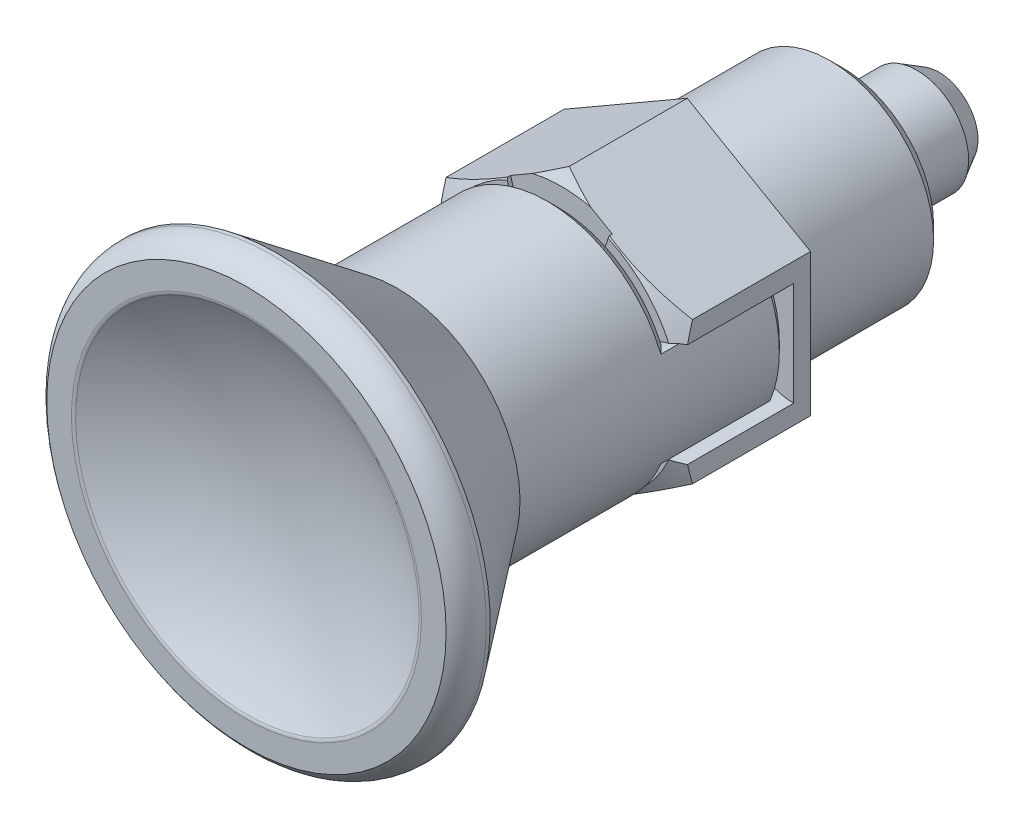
ISO-10303-21;
HEADER;
FILE_DESCRIPTION(('STEP AP214'),'2;1');
FILE_NAME('part.step','',(''),(''),'','','');
FILE_SCHEMA(('AUTOMOTIVE_DESIGN { 1 0 10303 214 1 1 1 1 }'));
ENDSEC;
DATA;
#1=APPLICATION_CONTEXT('core data for automotive mechanical design processes');
#2=APPLICATION_PROTOCOL_DEFINITION('international standard','automotive_design',2000,#1);
#3=PRODUCT_CONTEXT('',#1,'mechanical');
#4=PRODUCT('Part','Part','',(#3));
#5=PRODUCT_RELATED_PRODUCT_CATEGORY('part','',(#4));
#6=PRODUCT_DEFINITION_FORMATION('','',#4);
#7=PRODUCT_DEFINITION_CONTEXT('part definition',#1,'design');
#8=PRODUCT_DEFINITION('design','',#6,#7);
#9=PRODUCT_DEFINITION_SHAPE('','',#8);
#10=(LENGTH_UNIT() NAMED_UNIT(*) SI_UNIT(.MILLI.,.METRE.));
#11=(NAMED_UNIT(*) PLANE_ANGLE_UNIT() SI_UNIT($,.RADIAN.));
#12=(NAMED_UNIT(*) SI_UNIT($,.STERADIAN.) SOLID_ANGLE_UNIT());
#13=UNCERTAINTY_MEASURE_WITH_UNIT(LENGTH_MEASURE(1.E-05),#10,'distance_accuracy_value','');
#14=(GEOMETRIC_REPRESENTATION_CONTEXT(3) GLOBAL_UNCERTAINTY_ASSIGNED_CONTEXT((#13)) GLOBAL_UNIT_ASSIGNED_CONTEXT((#10,
#11,#12)) REPRESENTATION_CONTEXT('',''));
#15=CARTESIAN_POINT('',(0.,0.,0.));
#16=DIRECTION('',(0.,0.,1.));
#17=DIRECTION('',(1.,0.,0.));
#18=AXIS2_PLACEMENT_3D('',#15,#16,#17);
#19=CARTESIAN_POINT('',(-3.16809484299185,-7.65702656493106,-12.));
#20=DIRECTION('',(0.,0.,-1.));
#21=DIRECTION('',(-0.383049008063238,0.923728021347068,0.));
#22=AXIS2_PLACEMENT_3D('',#19,#20,#21);
#23=PLANE('',#22);
#24=CARTESIAN_POINT('',(0.,0.,-12.));
#25=DIRECTION('',(0.,0.,-1.));
#26=DIRECTION('',(-0.383049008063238,0.923728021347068,0.));
#27=AXIS2_PLACEMENT_3D('',#24,#25,#26);
#28=CIRCLE('',#27,4.1);
#29=CARTESIAN_POINT('',(-1.57050093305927,3.78728488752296,-12.));
#30=VERTEX_POINT('',#29);
#31=EDGE_CURVE('E9',#30,#30,#28,.T.);
#32=ORIENTED_EDGE('',*,*,#31,.F.);
#33=EDGE_LOOP('',(#32));
#34=FACE_BOUND('',#33,.T.);
#35=CARTESIAN_POINT('',(0.,0.,-12.));
#36=DIRECTION('',(0.,0.,-1.));
#37=DIRECTION('',(1.,0.,0.));
#38=AXIS2_PLACEMENT_3D('',#35,#36,#37);
#39=CIRCLE('',#38,7.);
#40=CARTESIAN_POINT('',(7.,0.,-12.));
#41=VERTEX_POINT('',#40);
#42=EDGE_CURVE('E2147',#41,#41,#39,.T.);
#43=ORIENTED_EDGE('',*,*,#42,.T.);
#44=EDGE_LOOP('',(#43));
#45=FACE_BOUND('',#44,.T.);
#46=ADVANCED_FACE('F15',(#34,#45),#23,.T.);
#47=CARTESIAN_POINT('',(0.,0.,-11.9999999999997));
#48=DIRECTION('',(0.,0.,-1.));
#49=DIRECTION('',(-0.383049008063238,0.923728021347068,0.));
#50=AXIS2_PLACEMENT_3D('',#47,#48,#49);
#51=SPHERICAL_SURFACE('',#50,8.0000000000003);
#52=CARTESIAN_POINT('',(0.,0.,-19.4113534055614));
#53=DIRECTION('',(0.,0.,-1.));
#54=DIRECTION('',(-0.383049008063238,0.923728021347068,0.));
#55=AXIS2_PLACEMENT_3D('',#52,#53,#54);
#56=CIRCLE('',#55,3.01194965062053);
#57=CARTESIAN_POINT('',(-1.15372432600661,2.78222229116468,-19.4113534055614));
#58=VERTEX_POINT('',#57);
#59=EDGE_CURVE('E2041',#58,#58,#56,.T.);
#60=ORIENTED_EDGE('',*,*,#59,.T.);
#61=EDGE_LOOP('',(#60));
#62=FACE_BOUND('',#61,.T.);
#63=ADVANCED_FACE('F1372',(#62),#51,.T.);
#64=CARTESIAN_POINT('',(0.,0.,-19.4113534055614));
#65=DIRECTION('',(0.,0.,1.));
#66=DIRECTION('',(-0.383049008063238,0.923728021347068,0.));
#67=AXIS2_PLACEMENT_3D('',#64,#65,#66);
#68=CONICAL_SURFACE('',#67,3.01194965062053,0.523598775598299);
#69=CARTESIAN_POINT('',(0.,0.,-17.7));
#70=DIRECTION('',(0.,0.,-1.));
#71=DIRECTION('',(-0.383049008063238,0.923728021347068,0.));
#72=AXIS2_PLACEMENT_3D('',#69,#70,#71);
#73=CIRCLE('',#72,4.);
#74=CARTESIAN_POINT('',(-1.53219603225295,3.69491208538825,-17.7));
#75=VERTEX_POINT('',#74);
#76=EDGE_CURVE('E2045',#75,#75,#73,.T.);
#77=ORIENTED_EDGE('',*,*,#76,.T.);
#78=EDGE_LOOP('',(#77));
#79=FACE_BOUND('',#78,.T.);
#80=ORIENTED_EDGE('',*,*,#59,.F.);
#81=EDGE_LOOP('',(#80));
#82=FACE_BOUND('',#81,.T.);
#83=ADVANCED_FACE('F1374',(#79,#82),#68,.T.);
#84=CARTESIAN_POINT('',(0.,0.,-12.5));
#85=DIRECTION('',(0.,0.,-1.));
#86=DIRECTION('',(-0.383049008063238,0.923728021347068,0.));
#87=AXIS2_PLACEMENT_3D('',#84,#85,#86);
#88=CYLINDRICAL_SURFACE('',#87,4.);
#89=CARTESIAN_POINT('',(0.,0.,-12.5));
#90=DIRECTION('',(0.,0.,-1.));
#91=DIRECTION('',(-0.383049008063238,0.923728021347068,0.));
#92=AXIS2_PLACEMENT_3D('',#89,#90,#91);
#93=CIRCLE('',#92,4.);
#94=CARTESIAN_POINT('',(-1.53219603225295,3.69491208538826,-12.5));
#95=VERTEX_POINT('',#94);
#96=EDGE_CURVE('E2056',#95,#95,#93,.T.);
#97=ORIENTED_EDGE('',*,*,#96,.T.);
#98=EDGE_LOOP('',(#97));
#99=FACE_BOUND('',#98,.T.);
#100=ORIENTED_EDGE('',*,*,#76,.F.);
#101=EDGE_LOOP('',(#100));
#102=FACE_BOUND('',#101,.T.);
#103=ADVANCED_FACE('F1381',(#99,#102),#88,.T.);
#104=CARTESIAN_POINT('',(0.,0.,-12.3732050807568));
#105=DIRECTION('',(0.,0.,-1.));
#106=DIRECTION('',(-0.383049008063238,0.923728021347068,0.));
#107=AXIS2_PLACEMENT_3D('',#104,#105,#106);
#108=CONICAL_SURFACE('',#107,3.92679491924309,0.523598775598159);
#109=CARTESIAN_POINT('',(0.,0.,-12.3732050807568));
#110=DIRECTION('',(0.,0.,-1.));
#111=DIRECTION('',(-0.383049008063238,0.923728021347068,0.));
#112=AXIS2_PLACEMENT_3D('',#109,#110,#111);
#113=CIRCLE('',#112,3.9267949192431);
#114=CARTESIAN_POINT('',(-1.50415489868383,3.62729050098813,-12.3732050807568));
#115=VERTEX_POINT('',#114);
#116=EDGE_CURVE('E2065',#115,#115,#113,.T.);
#117=ORIENTED_EDGE('',*,*,#116,.T.);
#118=EDGE_LOOP('',(#117));
#119=FACE_BOUND('',#118,.T.);
#120=ORIENTED_EDGE('',*,*,#96,.F.);
#121=EDGE_LOOP('',(#120));
#122=FACE_BOUND('',#121,.T.);
#123=ADVANCED_FACE('F1395',(#119,#122),#108,.T.);
#124=CARTESIAN_POINT('',(0.,0.,-12.2732050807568));
#125=DIRECTION('',(0.,0.,-1.));
#126=DIRECTION('',(0.,1.,0.));
#127=AXIS2_PLACEMENT_3D('',#124,#125,#126);
#128=TOROIDAL_SURFACE('',#127,4.09999999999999,0.199999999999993);
#129=CARTESIAN_POINT('',(0.,0.,-12.2732050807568));
#130=DIRECTION('',(0.,0.,-1.));
#131=DIRECTION('',(-0.383049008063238,0.923728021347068,0.));
#132=AXIS2_PLACEMENT_3D('',#129,#130,#131);
#133=CIRCLE('',#132,3.9);
#134=CARTESIAN_POINT('',(-1.49389113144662,3.60253928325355,-12.2732050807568));
#135=VERTEX_POINT('',#134);
#136=EDGE_CURVE('E2074',#135,#135,#133,.T.);
#137=ORIENTED_EDGE('',*,*,#136,.T.);
#138=EDGE_LOOP('',(#137));
#139=FACE_BOUND('',#138,.T.);
#140=ORIENTED_EDGE('',*,*,#116,.F.);
#141=EDGE_LOOP('',(#140));
#142=FACE_BOUND('',#141,.T.);
#143=ADVANCED_FACE('F1391',(#139,#142),#128,.F.);
#144=CARTESIAN_POINT('',(0.,0.,-12.2));
#145=DIRECTION('',(0.,0.,-1.));
#146=DIRECTION('',(-0.383049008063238,0.923728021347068,0.));
#147=AXIS2_PLACEMENT_3D('',#144,#145,#146);
#148=CYLINDRICAL_SURFACE('',#147,3.9);
#149=CARTESIAN_POINT('',(0.,0.,-12.2));
#150=DIRECTION('',(0.,0.,-1.));
#151=DIRECTION('',(-0.383049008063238,0.923728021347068,0.));
#152=AXIS2_PLACEMENT_3D('',#149,#150,#151);
#153=CIRCLE('',#152,3.9);
#154=CARTESIAN_POINT('',(-1.49389113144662,3.60253928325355,-12.2));
#155=VERTEX_POINT('',#154);
#156=EDGE_CURVE('E26',#155,#155,#153,.T.);
#157=ORIENTED_EDGE('',*,*,#156,.T.);
#158=EDGE_LOOP('',(#157));
#159=FACE_BOUND('',#158,.T.);
#160=ORIENTED_EDGE('',*,*,#136,.F.);
#161=EDGE_LOOP('',(#160));
#162=FACE_BOUND('',#161,.T.);
#163=ADVANCED_FACE('F1394',(#159,#162),#148,.T.);
#164=CARTESIAN_POINT('',(0.,0.,-12.2));
#165=DIRECTION('',(0.,0.,-1.));
#166=DIRECTION('',(-1.,0.,0.));
#167=AXIS2_PLACEMENT_3D('',#164,#165,#166);
#168=TOROIDAL_SURFACE('',#167,4.1,0.200000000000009);
#169=ORIENTED_EDGE('',*,*,#31,.T.);
#170=EDGE_LOOP('',(#169));
#171=FACE_BOUND('',#170,.T.);
#172=ORIENTED_EDGE('',*,*,#156,.F.);
#173=EDGE_LOOP('',(#172));
#174=FACE_BOUND('',#173,.T.);
#175=ADVANCED_FACE('F1387',(#171,#174),#168,.F.);
#176=CARTESIAN_POINT('',(0.,-7.25114412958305E-13,56.303508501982));
#177=DIRECTION('',(0.,0.,-1.));
#178=DIRECTION('',(0.,1.,0.));
#179=AXIS2_PLACEMENT_3D('',#176,#177,#178);
#180=SPHERICAL_SURFACE('',#179,25.9999999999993);
#181=CARTESIAN_POINT('',(0.,0.,33.9302548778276));
#182=DIRECTION('',(0.,0.,1.));
#183=DIRECTION('',(0.,1.,0.));
#184=AXIS2_PLACEMENT_3D('',#181,#182,#183);
#185=CIRCLE('',#184,13.2452830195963);
#186=CARTESIAN_POINT('',(0.,13.2452830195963,33.9302548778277));
#187=VERTEX_POINT('',#186);
#188=EDGE_CURVE('E1069',#187,#187,#185,.T.);
#189=ORIENTED_EDGE('',*,*,#188,.T.);
#190=EDGE_LOOP('',(#189));
#191=FACE_BOUND('',#190,.T.);
#192=ADVANCED_FACE('F1398',(#191),#180,.F.);
#193=CARTESIAN_POINT('',(0.,0.,33.5000000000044));
#194=DIRECTION('',(0.,0.,-1.));
#195=DIRECTION('',(-1.,0.,0.));
#196=AXIS2_PLACEMENT_3D('',#193,#194,#195);
#197=TOROIDAL_SURFACE('',#196,13.4999999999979,0.499999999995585);
#198=ORIENTED_EDGE('',*,*,#188,.F.);
#199=EDGE_LOOP('',(#198));
#200=FACE_BOUND('',#199,.T.);
#201=CARTESIAN_POINT('',(0.,0.,34.));
#202=DIRECTION('',(0.,0.,1.));
#203=DIRECTION('',(0.,1.,0.));
#204=AXIS2_PLACEMENT_3D('',#201,#202,#203);
#205=CIRCLE('',#204,13.5000000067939);
#206=CARTESIAN_POINT('',(0.,13.5000000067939,34.));
#207=VERTEX_POINT('',#206);
#208=EDGE_CURVE('E1061',#207,#207,#205,.T.);
#209=ORIENTED_EDGE('',*,*,#208,.T.);
#210=EDGE_LOOP('',(#209));
#211=FACE_BOUND('',#210,.T.);
#212=ADVANCED_FACE('F1400',(#200,#211),#197,.T.);
#213=CARTESIAN_POINT('',(16.9399999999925,-16.9399999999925,34.));
#214=DIRECTION('',(0.,0.,1.));
#215=DIRECTION('',(0.,1.,0.));
#216=AXIS2_PLACEMENT_3D('',#213,#214,#215);
#217=PLANE('',#216);
#218=CARTESIAN_POINT('',(0.,0.,34.0000000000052));
#219=DIRECTION('',(0.,0.,1.));
#220=DIRECTION('',(0.,1.,0.));
#221=AXIS2_PLACEMENT_3D('',#218,#219,#220);
#222=CIRCLE('',#221,15.3999999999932);
#223=CARTESIAN_POINT('',(0.,15.3999999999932,34.0000000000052));
#224=VERTEX_POINT('',#223);
#225=EDGE_CURVE('E1053',#224,#224,#222,.T.);
#226=ORIENTED_EDGE('',*,*,#225,.T.);
#227=EDGE_LOOP('',(#226));
#228=FACE_BOUND('',#227,.T.);
#229=ORIENTED_EDGE('',*,*,#208,.F.);
#230=EDGE_LOOP('',(#229));
#231=FACE_BOUND('',#230,.T.);
#232=ADVANCED_FACE('F1402',(#228,#231),#217,.T.);
#233=CARTESIAN_POINT('',(0.,0.,31.9280692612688));
#234=DIRECTION('',(0.,0.,-1.));
#235=DIRECTION('',(-1.,0.,0.));
#236=AXIS2_PLACEMENT_3D('',#233,#234,#235);
#237=TOROIDAL_SURFACE('',#236,14.0010350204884,2.50000000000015);
#238=ORIENTED_EDGE('',*,*,#225,.F.);
#239=EDGE_LOOP('',(#238));
#240=FACE_BOUND('',#239,.T.);
#241=CARTESIAN_POINT('',(0.,0.,32.));
#242=DIRECTION('',(0.,0.,-1.));
#243=DIRECTION('',(0.,1.,0.));
#244=AXIS2_PLACEMENT_3D('',#241,#242,#243);
#245=CIRCLE('',#244,16.5);
#246=CARTESIAN_POINT('',(0.,16.5,32.));
#247=VERTEX_POINT('',#246);
#248=EDGE_CURVE('E1037',#247,#247,#245,.T.);
#249=ORIENTED_EDGE('',*,*,#248,.F.);
#250=EDGE_LOOP('',(#249));
#251=FACE_BOUND('',#250,.T.);
#252=ADVANCED_FACE('F17',(#240,#251),#237,.T.);
#253=CARTESIAN_POINT('',(0.,0.,32.));
#254=DIRECTION('',(0.,0.,-1.));
#255=DIRECTION('',(0.,1.,0.));
#256=AXIS2_PLACEMENT_3D('',#253,#254,#255);
#257=CYLINDRICAL_SURFACE('',#256,16.5);
#258=ORIENTED_EDGE('',*,*,#248,.T.);
#259=EDGE_LOOP('',(#258));
#260=FACE_BOUND('',#259,.T.);
#261=CARTESIAN_POINT('',(0.,0.,31.7));
#262=DIRECTION('',(0.,0.,1.));
#263=DIRECTION('',(0.,1.,0.));
#264=AXIS2_PLACEMENT_3D('',#261,#262,#263);
#265=CIRCLE('',#264,16.5);
#266=CARTESIAN_POINT('',(0.,16.5,31.7));
#267=VERTEX_POINT('',#266);
#268=EDGE_CURVE('E1045',#267,#267,#265,.T.);
#269=ORIENTED_EDGE('',*,*,#268,.T.);
#270=EDGE_LOOP('',(#269));
#271=FACE_BOUND('',#270,.T.);
#272=ADVANCED_FACE('F1367',(#260,#271),#257,.T.);
#273=CARTESIAN_POINT('',(6.21050000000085,-4.0274095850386,1.70000000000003));
#274=DIRECTION('',(0.,0.,-1.));
#275=DIRECTION('',(0.,1.,0.));
#276=AXIS2_PLACEMENT_3D('',#273,#274,#275);
#277=PLANE('',#276);
#278=CARTESIAN_POINT('',(0.,0.,1.7));
#279=DIRECTION('',(0.,0.,-1.));
#280=DIRECTION('',(0.946542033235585,0.322580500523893,0.));
#281=AXIS2_PLACEMENT_3D('',#278,#279,#280);
#282=CIRCLE('',#281,8.8);
#283=CARTESIAN_POINT('',(8.32956989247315,2.83870840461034,1.70000000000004));
#284=VERTEX_POINT('',#283);
#285=CARTESIAN_POINT('',(8.32956989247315,-2.83870840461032,1.70000000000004));
#286=VERTEX_POINT('',#285);
#287=EDGE_CURVE('E1014',#284,#286,#282,.T.);
#288=ORIENTED_EDGE('',*,*,#287,.T.);
#289=CARTESIAN_POINT('',(9.3,-9.92261828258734E-13,1.70000000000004));
#290=DIRECTION('',(0.,0.,-1.));
#291=DIRECTION('',(-0.323476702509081,-0.946236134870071,0.));
#292=AXIS2_PLACEMENT_3D('',#289,#290,#291);
#293=CIRCLE('',#292,2.99999999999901);
#294=EDGE_CURVE('E1021',#286,#284,#293,.T.);
#295=ORIENTED_EDGE('',*,*,#294,.T.);
#296=EDGE_LOOP('',(#288,#295));
#297=FACE_BOUND('',#296,.T.);
#298=ADVANCED_FACE('F1358',(#297),#277,.T.);
#299=CARTESIAN_POINT('',(-9.695,-4.02740958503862,1.7));
#300=DIRECTION('',(0.,0.,-1.));
#301=DIRECTION('',(0.,1.,0.));
#302=AXIS2_PLACEMENT_3D('',#299,#300,#301);
#303=PLANE('',#302);
#304=CARTESIAN_POINT('',(-9.29999999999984,7.06032454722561E-13,1.7));
#305=DIRECTION('',(0.,0.,-1.));
#306=DIRECTION('',(0.323476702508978,0.946236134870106,0.));
#307=AXIS2_PLACEMENT_3D('',#304,#305,#306);
#308=CIRCLE('',#307,2.9999999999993);
#309=CARTESIAN_POINT('',(-8.32956989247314,2.83870840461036,1.7));
#310=VERTEX_POINT('',#309);
#311=CARTESIAN_POINT('',(-8.32956989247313,-2.83870840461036,1.7));
#312=VERTEX_POINT('',#311);
#313=EDGE_CURVE('E1092',#310,#312,#308,.T.);
#314=ORIENTED_EDGE('',*,*,#313,.T.);
#315=CARTESIAN_POINT('',(0.,0.,1.7));
#316=DIRECTION('',(0.,0.,-1.));
#317=DIRECTION('',(-0.946542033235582,-0.322580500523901,0.));
#318=AXIS2_PLACEMENT_3D('',#315,#316,#317);
#319=CIRCLE('',#318,8.8);
#320=EDGE_CURVE('E1099',#312,#310,#319,.T.);
#321=ORIENTED_EDGE('',*,*,#320,.T.);
#322=EDGE_LOOP('',(#314,#321));
#323=FACE_BOUND('',#322,.T.);
#324=ADVANCED_FACE('F1337',(#323),#303,.T.);
#325=CARTESIAN_POINT('',(0.,0.,22.4));
#326=DIRECTION('',(0.,0.,1.));
#327=DIRECTION('',(0.,1.,0.));
#328=AXIS2_PLACEMENT_3D('',#325,#326,#327);
#329=CONICAL_SURFACE('',#328,9.5,0.645219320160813);
#330=ORIENTED_EDGE('',*,*,#268,.F.);
#331=EDGE_LOOP('',(#330));
#332=FACE_BOUND('',#331,.T.);
#333=CARTESIAN_POINT('',(0.,0.,22.4));
#334=DIRECTION('',(0.,0.,1.));
#335=DIRECTION('',(0.,1.,0.));
#336=AXIS2_PLACEMENT_3D('',#333,#334,#335);
#337=CIRCLE('',#336,9.5);
#338=CARTESIAN_POINT('',(0.,9.5,22.4));
#339=VERTEX_POINT('',#338);
#340=EDGE_CURVE('E1029',#339,#339,#337,.T.);
#341=ORIENTED_EDGE('',*,*,#340,.T.);
#342=EDGE_LOOP('',(#341));
#343=FACE_BOUND('',#342,.T.);
#344=ADVANCED_FACE('F1357',(#332,#343),#329,.T.);
#345=CARTESIAN_POINT('',(0.,0.,1.7));
#346=DIRECTION('',(0.,0.,1.));
#347=DIRECTION('',(-0.922750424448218,-0.385398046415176,0.));
#348=AXIS2_PLACEMENT_3D('',#345,#346,#347);
#349=CONICAL_SURFACE('',#348,8.8,0.785398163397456);
#350=CARTESIAN_POINT('',(-8.76612903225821,-3.66128144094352,2.4000000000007));
#351=CARTESIAN_POINT('',(-8.7441150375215,-3.62242797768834,2.36473359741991));
#352=CARTESIAN_POINT('',(-8.72247571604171,-3.58334910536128,2.32948587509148));
#353=CARTESIAN_POINT('',(-8.68179773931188,-3.50866715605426,2.26262441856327));
#354=CARTESIAN_POINT('',(-8.66271342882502,-3.47310228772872,2.23099583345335));
#355=CARTESIAN_POINT('',(-8.62679712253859,-3.40553212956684,2.17135995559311));
#356=CARTESIAN_POINT('',(-8.60994449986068,-3.37355728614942,2.14333051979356));
#357=CARTESIAN_POINT('',(-8.57802273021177,-3.31325332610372,2.09094083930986));
#358=CARTESIAN_POINT('',(-8.56298048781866,-3.28494403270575,2.06654154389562));
#359=CARTESIAN_POINT('',(-8.53010804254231,-3.22357046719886,2.01414199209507));
#360=CARTESIAN_POINT('',(-8.5122230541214,-3.19048327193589,1.98620303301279));
#361=CARTESIAN_POINT('',(-8.47611651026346,-3.123183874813,1.92991863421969));
#362=CARTESIAN_POINT('',(-8.45789767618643,-3.08896418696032,1.90158041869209));
#363=CARTESIAN_POINT('',(-8.42125201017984,-3.01937692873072,1.84453309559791));
#364=CARTESIAN_POINT('',(-8.40283020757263,-2.98400117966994,1.81583070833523));
#365=CARTESIAN_POINT('',(-8.36601438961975,-2.91207168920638,1.75805014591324));
#366=CARTESIAN_POINT('',(-8.34762957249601,-2.87550900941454,1.72897724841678));
#367=CARTESIAN_POINT('',(-8.32956989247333,-2.83870840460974,1.70000000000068));
#368=B_SPLINE_CURVE_WITH_KNOTS('',3,(#350,#351,#352,#353,#354,#355,#356,#357,#358,#359,#360,
#361,#362,#363,#364,#365,#366,#367),.UNSPECIFIED.,.F.,.F.,(4,2,2,2,2,2,2,2,4),(0.,
0.170703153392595,0.324534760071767,0.461750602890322,0.582607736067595,0.723164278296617,
0.867223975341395,1.01463685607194,1.16523441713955),.UNSPECIFIED.);
#369=CARTESIAN_POINT('',(-8.76612903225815,-3.6612814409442,2.4));
#370=VERTEX_POINT('',#369);
#371=EDGE_CURVE('E1085',#370,#312,#368,.T.);
#372=ORIENTED_EDGE('',*,*,#371,.F.);
#373=CARTESIAN_POINT('',(0.,0.,2.40000000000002));
#374=DIRECTION('',(0.,0.,1.));
#375=DIRECTION('',(-0.922750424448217,0.385398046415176,0.));
#376=AXIS2_PLACEMENT_3D('',#373,#374,#375);
#377=CIRCLE('',#376,9.5);
#378=CARTESIAN_POINT('',(-8.76612903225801,3.66128144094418,2.4));
#379=VERTEX_POINT('',#378);
#380=EDGE_CURVE('E993',#379,#370,#377,.T.);
#381=ORIENTED_EDGE('',*,*,#380,.F.);
#382=CARTESIAN_POINT('',(-8.32956989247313,2.83870840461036,1.7));
#383=CARTESIAN_POINT('',(-8.34762669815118,2.87550317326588,1.72897266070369));
#384=CARTESIAN_POINT('',(-8.36600832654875,2.91206012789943,1.75804103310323));
#385=CARTESIAN_POINT('',(-8.40281944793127,2.98398210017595,1.81581554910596));
#386=CARTESIAN_POINT('',(-8.42123979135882,3.0193560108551,1.84451644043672));
#387=CARTESIAN_POINT('',(-8.45788469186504,3.08894345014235,1.90156381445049));
#388=CARTESIAN_POINT('',(-8.47610424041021,3.12316511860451,1.92990361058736));
#389=CARTESIAN_POINT('',(-8.51221539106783,3.19047211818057,1.98619400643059));
#390=CARTESIAN_POINT('',(-8.5301042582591,3.2235649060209,2.01413742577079));
#391=CARTESIAN_POINT('',(-8.56297860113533,3.28493921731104,2.0665372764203));
#392=CARTESIAN_POINT('',(-8.57801899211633,3.31324371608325,2.09093226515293));
#393=CARTESIAN_POINT('',(-8.60993801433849,3.3735413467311,2.14331620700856));
#394=CARTESIAN_POINT('',(-8.62678961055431,3.40551466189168,2.17134428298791));
#395=CARTESIAN_POINT('',(-8.66270539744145,3.47308493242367,2.23098020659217));
#396=CARTESIAN_POINT('',(-8.68179022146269,3.50865141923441,2.26261021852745));
#397=CARTESIAN_POINT('',(-8.72247095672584,3.58333973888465,2.32947736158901));
#398=CARTESIAN_POINT('',(-8.74411256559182,3.62242332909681,2.36472935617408));
#399=CARTESIAN_POINT('',(-8.76612903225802,3.6612814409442,2.39999999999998));
#400=B_SPLINE_CURVE_WITH_KNOTS('',3,(#382,#383,#384,#385,#386,#387,#388,#389,#390,#391,#392,
#393,#394,#395,#396,#397,#398,#399),.UNSPECIFIED.,.F.,.F.,(4,2,2,2,2,2,2,2,4),(0.,
0.150573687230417,0.297978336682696,0.442045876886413,0.582626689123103,0.703463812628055,
0.840672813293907,0.994511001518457,1.16523442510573),.UNSPECIFIED.);
#401=EDGE_CURVE('E1077',#310,#379,#400,.T.);
#402=ORIENTED_EDGE('',*,*,#401,.F.);
#403=ORIENTED_EDGE('',*,*,#320,.F.);
#404=EDGE_LOOP('',(#372,#381,#402,#403));
#405=FACE_BOUND('',#404,.T.);
#406=ADVANCED_FACE('F1290',(#405),#349,.T.);
#407=CARTESIAN_POINT('',(0.,0.,1.7));
#408=DIRECTION('',(0.,0.,1.));
#409=DIRECTION('',(0.922750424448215,0.385398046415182,0.));
#410=AXIS2_PLACEMENT_3D('',#407,#408,#409);
#411=CONICAL_SURFACE('',#410,8.8,0.785398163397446);
#412=CARTESIAN_POINT('',(8.32956989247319,2.8387084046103,1.70000000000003));
#413=CARTESIAN_POINT('',(8.34468735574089,2.86945124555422,1.72422776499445));
#414=CARTESIAN_POINT('',(8.36002572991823,2.8999104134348,1.74867045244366));
#415=CARTESIAN_POINT('',(8.39260987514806,2.96355719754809,1.80044345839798));
#416=CARTESIAN_POINT('',(8.40988809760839,2.9966990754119,1.82780968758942));
#417=CARTESIAN_POINT('',(8.44626282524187,3.0658137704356,1.88542231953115));
#418=CARTESIAN_POINT('',(8.46537588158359,3.10175583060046,1.91569496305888));
#419=CARTESIAN_POINT('',(8.50538830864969,3.17651457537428,1.97915265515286));
#420=CARTESIAN_POINT('',(8.52629732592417,3.21530690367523,2.01236027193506));
#421=CARTESIAN_POINT('',(8.569424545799,3.29560393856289,2.08123594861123));
#422=CARTESIAN_POINT('',(8.59163130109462,3.33710735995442,2.11691266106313));
#423=CARTESIAN_POINT('',(8.63323087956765,3.41522030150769,2.18416279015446));
#424=CARTESIAN_POINT('',(8.65264632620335,3.451828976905,2.21572325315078));
#425=CARTESIAN_POINT('',(8.68889867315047,3.51992083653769,2.27476803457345));
#426=CARTESIAN_POINT('',(8.7057297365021,3.55142860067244,2.30222728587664));
#427=CARTESIAN_POINT('',(8.737047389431,3.60909012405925,2.35310332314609));
#428=CARTESIAN_POINT('',(8.7514868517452,3.63530730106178,2.37647740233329));
#429=CARTESIAN_POINT('',(8.7661290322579,3.6612814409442,2.39999999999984));
#430=B_SPLINE_CURVE_WITH_KNOTS('',3,(#412,#413,#414,#415,#416,#417,#418,#419,#420,#421,#422,
#423,#424,#425,#426,#427,#428,#429),.UNSPECIFIED.,.F.,.F.,(4,2,2,2,2,2,2,2,4),(0.,
0.125872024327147,0.264836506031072,0.417026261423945,0.582563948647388,0.759754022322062,
0.916020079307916,1.05118469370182,1.16511281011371),.UNSPECIFIED.);
#431=CARTESIAN_POINT('',(8.76612903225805,3.66128144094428,2.40000000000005));
#432=VERTEX_POINT('',#431);
#433=EDGE_CURVE('E999',#284,#432,#430,.T.);
#434=ORIENTED_EDGE('',*,*,#433,.T.);
#435=CARTESIAN_POINT('',(0.,0.,2.40000000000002));
#436=DIRECTION('',(0.,0.,1.));
#437=DIRECTION('',(0.922750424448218,-0.385398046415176,0.));
#438=AXIS2_PLACEMENT_3D('',#435,#436,#437);
#439=CIRCLE('',#438,9.5);
#440=CARTESIAN_POINT('',(8.7661290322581,-3.66128144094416,2.40000000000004));
#441=VERTEX_POINT('',#440);
#442=EDGE_CURVE('E980',#441,#432,#439,.T.);
#443=ORIENTED_EDGE('',*,*,#442,.F.);
#444=CARTESIAN_POINT('',(8.76612903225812,-3.66128144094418,2.40000000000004));
#445=CARTESIAN_POINT('',(8.75148748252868,-3.63530752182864,2.37647806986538));
#446=CARTESIAN_POINT('',(8.7370485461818,-3.60909067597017,2.35310460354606));
#447=CARTESIAN_POINT('',(8.70573161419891,-3.55142957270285,2.30222939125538));
#448=CARTESIAN_POINT('',(8.68890071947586,-3.5199219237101,2.2747703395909));
#449=CARTESIAN_POINT('',(8.65264838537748,-3.45183004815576,2.21572556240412));
#450=CARTESIAN_POINT('',(8.63323276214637,-3.41522126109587,2.18416489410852));
#451=CARTESIAN_POINT('',(8.5916324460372,-3.33710791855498,2.11691392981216));
#452=CARTESIAN_POINT('',(8.56942510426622,-3.29560423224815,2.08123657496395));
#453=CARTESIAN_POINT('',(8.52629861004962,-3.21530999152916,2.01236257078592));
#454=CARTESIAN_POINT('',(8.50539091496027,-3.17652072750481,1.97915725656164));
#455=CARTESIAN_POINT('',(8.46538033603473,-3.10176599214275,1.91570264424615));
#456=CARTESIAN_POINT('',(8.44626779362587,-3.06582487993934,1.88543078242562));
#457=CARTESIAN_POINT('',(8.40989317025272,-2.99671008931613,1.82781816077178));
#458=CARTESIAN_POINT('',(8.3926145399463,-2.96356715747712,1.800451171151));
#459=CARTESIAN_POINT('',(8.36002856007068,-2.89991636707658,1.74867507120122));
#460=CARTESIAN_POINT('',(8.34468878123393,-2.86945421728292,1.72423007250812));
#461=CARTESIAN_POINT('',(8.32956989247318,-2.83870840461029,1.70000000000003));
#462=B_SPLINE_CURVE_WITH_KNOTS('',3,(#444,#445,#446,#447,#448,#449,#450,#451,#452,#453,#454,
#455,#456,#457,#458,#459,#460,#461),.UNSPECIFIED.,.F.,.F.,(4,2,2,2,2,2,2,2,4),(0.,
0.113925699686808,0.249089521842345,0.405356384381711,0.582548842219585,0.748074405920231,
0.90026016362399,1.03922871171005,1.16511280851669),.UNSPECIFIED.);
#463=EDGE_CURVE('E1007',#441,#286,#462,.T.);
#464=ORIENTED_EDGE('',*,*,#463,.T.);
#465=ORIENTED_EDGE('',*,*,#287,.F.);
#466=EDGE_LOOP('',(#434,#443,#464,#465));
#467=FACE_BOUND('',#466,.T.);
#468=ADVANCED_FACE('F1279',(#467),#411,.T.);
#469=CARTESIAN_POINT('',(9.3,-1.01307850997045E-12,1.70000000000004));
#470=DIRECTION('',(0.,0.,1.));
#471=DIRECTION('',(-0.144289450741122,-0.9895355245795,0.));
#472=AXIS2_PLACEMENT_3D('',#469,#470,#471);
#473=CONICAL_SURFACE('',#472,2.99999999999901,0.785398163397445);
#474=ORIENTED_EDGE('',*,*,#463,.F.);
#475=CARTESIAN_POINT('',(9.3,-9.92261828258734E-13,2.40000000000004));
#476=DIRECTION('',(0.,0.,1.));
#477=DIRECTION('',(-0.14428945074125,0.989535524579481,0.));
#478=AXIS2_PLACEMENT_3D('',#475,#476,#477);
#479=CIRCLE('',#478,3.69999999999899);
#480=EDGE_CURVE('E910',#432,#441,#479,.T.);
#481=ORIENTED_EDGE('',*,*,#480,.F.);
#482=ORIENTED_EDGE('',*,*,#433,.F.);
#483=ORIENTED_EDGE('',*,*,#294,.F.);
#484=EDGE_LOOP('',(#474,#481,#482,#483));
#485=FACE_BOUND('',#484,.T.);
#486=ADVANCED_FACE('F1289',(#485),#473,.T.);
#487=CARTESIAN_POINT('',(-9.29999999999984,6.85215773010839E-13,1.7));
#488=DIRECTION('',(0.,0.,1.));
#489=DIRECTION('',(0.144289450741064,0.989535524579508,0.));
#490=AXIS2_PLACEMENT_3D('',#487,#488,#489);
#491=CONICAL_SURFACE('',#490,2.99999999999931,0.785398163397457);
#492=ORIENTED_EDGE('',*,*,#401,.T.);
#493=CARTESIAN_POINT('',(-9.29999999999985,6.85215773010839E-13,2.4));
#494=DIRECTION('',(0.,0.,1.));
#495=DIRECTION('',(0.144289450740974,-0.989535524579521,0.));
#496=AXIS2_PLACEMENT_3D('',#493,#494,#495);
#497=CIRCLE('',#496,3.6999999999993);
#498=EDGE_CURVE('E941',#370,#379,#497,.T.);
#499=ORIENTED_EDGE('',*,*,#498,.F.);
#500=ORIENTED_EDGE('',*,*,#371,.T.);
#501=ORIENTED_EDGE('',*,*,#313,.F.);
#502=EDGE_LOOP('',(#492,#499,#500,#501));
#503=FACE_BOUND('',#502,.T.);
#504=ADVANCED_FACE('F1328',(#503),#491,.T.);
#505=CARTESIAN_POINT('',(0.,0.,22.5));
#506=DIRECTION('',(0.,0.,-1.));
#507=DIRECTION('',(0.,1.,0.));
#508=AXIS2_PLACEMENT_3D('',#505,#506,#507);
#509=CYLINDRICAL_SURFACE('',#508,9.5);
#510=DIRECTION('',(0.,0.,-1.));
#511=VECTOR('',#510,1.);
#512=CARTESIAN_POINT('',(-8.76612903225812,-3.6612814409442,10.8));
#513=LINE('',#512,#511);
#514=CARTESIAN_POINT('',(-8.76612903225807,-3.66128144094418,10.8));
#515=VERTEX_POINT('',#514);
#516=EDGE_CURVE('E934',#515,#370,#513,.T.);
#517=ORIENTED_EDGE('',*,*,#516,.F.);
#518=CARTESIAN_POINT('',(0.,0.,10.8));
#519=DIRECTION('',(0.,0.,1.));
#520=DIRECTION('',(-0.922750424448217,-0.385398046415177,0.));
#521=AXIS2_PLACEMENT_3D('',#518,#519,#520);
#522=CIRCLE('',#521,9.5);
#523=CARTESIAN_POINT('',(8.76612903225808,-3.66128144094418,10.8));
#524=VERTEX_POINT('',#523);
#525=EDGE_CURVE('E972',#515,#524,#522,.T.);
#526=ORIENTED_EDGE('',*,*,#525,.T.);
#527=DIRECTION('',(0.,0.,1.));
#528=VECTOR('',#527,1.);
#529=CARTESIAN_POINT('',(8.7661290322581,-3.66128144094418,2.40000000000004));
#530=LINE('',#529,#528);
#531=EDGE_CURVE('E918',#441,#524,#530,.T.);
#532=ORIENTED_EDGE('',*,*,#531,.F.);
#533=ORIENTED_EDGE('',*,*,#442,.T.);
#534=DIRECTION('',(0.,0.,-1.));
#535=VECTOR('',#534,1.);
#536=CARTESIAN_POINT('',(8.76612903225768,3.66128144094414,10.8));
#537=LINE('',#536,#535);
#538=CARTESIAN_POINT('',(8.76612903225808,3.66128144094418,10.8));
#539=VERTEX_POINT('',#538);
#540=EDGE_CURVE('E903',#539,#432,#537,.T.);
#541=ORIENTED_EDGE('',*,*,#540,.F.);
#542=CARTESIAN_POINT('',(0.,0.,10.8));
#543=DIRECTION('',(0.,0.,1.));
#544=DIRECTION('',(0.922750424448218,0.385398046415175,0.));
#545=AXIS2_PLACEMENT_3D('',#542,#543,#544);
#546=CIRCLE('',#545,9.5);
#547=CARTESIAN_POINT('',(-8.76612903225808,3.6612814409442,10.8));
#548=VERTEX_POINT('',#547);
#549=EDGE_CURVE('E988',#539,#548,#546,.T.);
#550=ORIENTED_EDGE('',*,*,#549,.T.);
#551=DIRECTION('',(0.,0.,1.));
#552=VECTOR('',#551,1.);
#553=CARTESIAN_POINT('',(-8.76612903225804,3.66128144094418,2.4));
#554=LINE('',#553,#552);
#555=EDGE_CURVE('E949',#379,#548,#554,.T.);
#556=ORIENTED_EDGE('',*,*,#555,.F.);
#557=ORIENTED_EDGE('',*,*,#380,.T.);
#558=EDGE_LOOP('',(#517,#526,#532,#533,#541,#550,#556,#557));
#559=FACE_BOUND('',#558,.T.);
#560=ORIENTED_EDGE('',*,*,#340,.F.);
#561=EDGE_LOOP('',(#560));
#562=FACE_BOUND('',#561,.T.);
#563=ADVANCED_FACE('F1224',(#559,#562),#509,.T.);
#564=CARTESIAN_POINT('',(9.3,1.10501885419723E-12,11.2450000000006));
#565=DIRECTION('',(0.,-1.6077271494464E-13,-1.));
#566=DIRECTION('',(-0.00405960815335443,-0.99999175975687,1.60844293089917E-13));
#567=AXIS2_PLACEMENT_3D('',#564,#565,#566);
#568=CYLINDRICAL_SURFACE('',#567,3.70000000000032);
#569=CARTESIAN_POINT('',(8.76612903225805,-3.66128144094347,10.8));
#570=CARTESIAN_POINT('',(8.73901588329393,-3.65732777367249,10.7734559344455));
#571=CARTESIAN_POINT('',(8.71198631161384,-3.65307901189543,10.746870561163));
#572=CARTESIAN_POINT('',(8.65621852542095,-3.64367947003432,10.6917758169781));
#573=CARTESIAN_POINT('',(8.6274924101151,-3.63848647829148,10.6632613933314));
#574=CARTESIAN_POINT('',(8.56836900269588,-3.62707601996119,10.6043088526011));
#575=CARTESIAN_POINT('',(8.53798468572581,-3.62081386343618,10.5738663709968));
#576=CARTESIAN_POINT('',(8.47559108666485,-3.60713617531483,10.5110568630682));
#577=CARTESIAN_POINT('',(8.44359602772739,-3.59967353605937,10.478685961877));
#578=CARTESIAN_POINT('',(8.37803534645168,-3.58346008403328,10.4120192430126));
#579=CARTESIAN_POINT('',(8.34448545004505,-3.57465982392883,10.3777199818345));
#580=CARTESIAN_POINT('',(8.27587912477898,-3.55563099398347,10.307196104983));
#581=CARTESIAN_POINT('',(8.24084020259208,-3.54535072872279,10.2709684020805));
#582=CARTESIAN_POINT('',(8.16933024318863,-3.52321702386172,10.1965874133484));
#583=CARTESIAN_POINT('',(8.13287875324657,-3.51130974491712,10.1584313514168));
#584=CARTESIAN_POINT('',(8.05862991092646,-3.48577343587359,10.0801929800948));
#585=CARTESIAN_POINT('',(8.02085442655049,-3.47208855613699,10.0401081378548));
#586=CARTESIAN_POINT('',(7.98333333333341,-3.45780116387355,10.));
#587=B_SPLINE_CURVE_WITH_KNOTS('',3,(#569,#570,#571,#572,#573,#574,#575,#576,#577,#578,#579,
#580,#581,#582,#583,#584,#585,#586),.UNSPECIFIED.,.F.,.F.,(4,2,2,2,2,2,2,2,4),(0.,
0.114445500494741,0.236861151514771,0.367247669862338,0.505605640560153,0.651935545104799,
0.806237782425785,0.968512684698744,1.1387605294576),.UNSPECIFIED.);
#588=CARTESIAN_POINT('',(7.98333333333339,-3.45780116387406,10.));
#589=VERTEX_POINT('',#588);
#590=EDGE_CURVE('E880',#524,#589,#587,.T.);
#591=ORIENTED_EDGE('',*,*,#590,.T.);
#592=CARTESIAN_POINT('',(9.3,0.,10.));
#593=DIRECTION('',(0.,0.,-1.));
#594=DIRECTION('',(-0.355855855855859,-0.934540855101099,0.));
#595=AXIS2_PLACEMENT_3D('',#592,#593,#594);
#596=CIRCLE('',#595,3.7);
#597=CARTESIAN_POINT('',(7.98333333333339,3.45780116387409,10.));
#598=VERTEX_POINT('',#597);
#599=EDGE_CURVE('E888',#589,#598,#596,.T.);
#600=ORIENTED_EDGE('',*,*,#599,.T.);
#601=CARTESIAN_POINT('',(7.98333333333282,3.45780116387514,10.));
#602=CARTESIAN_POINT('',(8.02085442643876,3.47208855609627,10.0401081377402));
#603=CARTESIAN_POINT('',(8.05862991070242,3.48577343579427,10.0801929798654));
#604=CARTESIAN_POINT('',(8.13287875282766,3.51130974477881,10.1584313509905));
#605=CARTESIAN_POINT('',(8.16933024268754,3.52321702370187,10.19658741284));
#606=CARTESIAN_POINT('',(8.24084020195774,3.54535072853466,10.2709684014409));
#607=CARTESIAN_POINT('',(8.27587912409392,3.55563099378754,10.3071961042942));
#608=CARTESIAN_POINT('',(8.3444854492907,3.57465982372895,10.37771998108));
#609=CARTESIAN_POINT('',(8.37803534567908,3.58346008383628,10.4120192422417));
#610=CARTESIAN_POINT('',(8.44359602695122,3.59967353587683,10.4786859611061));
#611=CARTESIAN_POINT('',(8.47559108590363,3.60713617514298,10.5110568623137));
#612=CARTESIAN_POINT('',(8.53798468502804,3.62081386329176,10.5738663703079));
#613=CARTESIAN_POINT('',(8.56836900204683,3.62707601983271,10.6043088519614));
#614=CARTESIAN_POINT('',(8.62749240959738,3.63848647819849,10.663261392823));
#615=CARTESIAN_POINT('',(8.65621852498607,3.64367946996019,10.6917758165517));
#616=CARTESIAN_POINT('',(8.71198631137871,3.65307901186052,10.7468705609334));
#617=CARTESIAN_POINT('',(8.73901588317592,3.65732777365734,10.7734559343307));
#618=CARTESIAN_POINT('',(8.76612903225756,3.66128144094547,10.8));
#619=B_SPLINE_CURVE_WITH_KNOTS('',3,(#601,#602,#603,#604,#605,#606,#607,#608,#609,#610,#611,
#612,#613,#614,#615,#616,#617,#618),.UNSPECIFIED.,.F.,.F.,(4,2,2,2,2,2,2,2,4),(0.,
0.170247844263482,0.332522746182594,0.486824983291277,0.633154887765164,0.771512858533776,
0.901899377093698,1.02431502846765,1.13876052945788),.UNSPECIFIED.);
#620=EDGE_CURVE('E895',#598,#539,#619,.T.);
#621=ORIENTED_EDGE('',*,*,#620,.T.);
#622=ORIENTED_EDGE('',*,*,#540,.T.);
#623=ORIENTED_EDGE('',*,*,#480,.T.);
#624=ORIENTED_EDGE('',*,*,#531,.T.);
#625=EDGE_LOOP('',(#591,#600,#621,#622,#623,#624));
#626=FACE_BOUND('',#625,.T.);
#627=ADVANCED_FACE('F1207',(#626),#568,.T.);
#628=CARTESIAN_POINT('',(-9.2999999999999,-1.61502755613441E-12,11.2450000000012));
#629=DIRECTION('',(0.,2.993932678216E-13,-1.));
#630=DIRECTION('',(0.0109073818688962,0.999940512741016,2.99276546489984E-13));
#631=AXIS2_PLACEMENT_3D('',#628,#629,#630);
#632=CYLINDRICAL_SURFACE('',#631,3.7000000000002);
#633=CARTESIAN_POINT('',(-7.98333333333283,-3.45780116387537,10.));
#634=CARTESIAN_POINT('',(-8.02085442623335,-3.47208855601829,10.0401081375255));
#635=CARTESIAN_POINT('',(-8.05862991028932,-3.48577343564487,10.0801929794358));
#636=CARTESIAN_POINT('',(-8.13287875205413,-3.51130974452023,10.1584313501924));
#637=CARTESIAN_POINT('',(-8.16933024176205,-3.52321702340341,10.1965874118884));
#638=CARTESIAN_POINT('',(-8.24084020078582,-3.54535072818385,10.2709684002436));
#639=CARTESIAN_POINT('',(-8.2758791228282,-3.55563099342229,10.3071961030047));
#640=CARTESIAN_POINT('',(-8.34448544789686,-3.57465982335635,10.3777199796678));
#641=CARTESIAN_POINT('',(-8.37803534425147,-3.58346008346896,10.4120192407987));
#642=CARTESIAN_POINT('',(-8.44359602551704,-3.5996735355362,10.4786859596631));
#643=CARTESIAN_POINT('',(-8.47559108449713,-3.60713617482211,10.5110568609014));
#644=CARTESIAN_POINT('',(-8.53798468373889,-3.62081386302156,10.5738663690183));
#645=CARTESIAN_POINT('',(-8.56836900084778,-3.62707601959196,10.6043088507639));
#646=CARTESIAN_POINT('',(-8.62749240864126,-3.63848647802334,10.6632613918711));
#647=CARTESIAN_POINT('',(-8.65621852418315,-3.64367946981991,10.6917758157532));
#648=CARTESIAN_POINT('',(-8.71198631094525,-3.65307901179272,10.7468705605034));
#649=CARTESIAN_POINT('',(-8.73901588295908,-3.65732777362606,10.7734559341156));
#650=CARTESIAN_POINT('',(-8.76612903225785,-3.66128144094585,10.8));
#651=B_SPLINE_CURVE_WITH_KNOTS('',3,(#633,#634,#635,#636,#637,#638,#639,#640,#641,#642,#643,
#644,#645,#646,#647,#648,#649,#650),.UNSPECIFIED.,.F.,.F.,(4,2,2,2,2,2,2,2,4),(0.,
0.170247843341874,0.332522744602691,0.486824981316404,0.63315488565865,0.771512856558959,
0.901899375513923,1.02431502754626,1.13876052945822),.UNSPECIFIED.);
#652=CARTESIAN_POINT('',(-7.98333333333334,-3.4578011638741,10.));
#653=VERTEX_POINT('',#652);
#654=EDGE_CURVE('E926',#653,#515,#651,.T.);
#655=ORIENTED_EDGE('',*,*,#654,.T.);
#656=ORIENTED_EDGE('',*,*,#516,.T.);
#657=ORIENTED_EDGE('',*,*,#498,.T.);
#658=ORIENTED_EDGE('',*,*,#555,.T.);
#659=CARTESIAN_POINT('',(-8.76612903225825,3.66128144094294,10.8000000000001));
#660=CARTESIAN_POINT('',(-8.73901588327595,3.65732777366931,10.7734559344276));
#661=CARTESIAN_POINT('',(-8.71198631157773,3.6530790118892,10.7468705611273));
#662=CARTESIAN_POINT('',(-8.65621852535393,3.64367947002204,10.6917758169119));
#663=CARTESIAN_POINT('',(-8.62749241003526,3.63848647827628,10.6632613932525));
#664=CARTESIAN_POINT('',(-8.56836900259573,3.62707601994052,10.6043088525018));
#665=CARTESIAN_POINT('',(-8.53798468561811,3.62081386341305,10.5738663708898));
#666=CARTESIAN_POINT('',(-8.47559108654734,3.60713617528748,10.5110568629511));
#667=CARTESIAN_POINT('',(-8.44359602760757,3.59967353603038,10.4786859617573));
#668=CARTESIAN_POINT('',(-8.37803534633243,3.58346008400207,10.4120192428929));
#669=CARTESIAN_POINT('',(-8.34448544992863,3.57465982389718,10.3777199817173));
#670=CARTESIAN_POINT('',(-8.27587912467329,3.55563099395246,10.307196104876));
#671=CARTESIAN_POINT('',(-8.24084020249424,3.545350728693,10.2709684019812));
#672=CARTESIAN_POINT('',(-8.16933024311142,3.52321702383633,10.1965874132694));
#673=CARTESIAN_POINT('',(-8.13287875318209,3.51130974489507,10.1584313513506));
#674=CARTESIAN_POINT('',(-8.05862991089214,3.4857734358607,10.0801929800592));
#675=CARTESIAN_POINT('',(-8.02085442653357,3.47208855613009,10.040108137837));
#676=CARTESIAN_POINT('',(-7.98333333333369,3.45780116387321,10.));
#677=B_SPLINE_CURVE_WITH_KNOTS('',3,(#659,#660,#661,#662,#663,#664,#665,#666,#667,#668,#669,
#670,#671,#672,#673,#674,#675,#676),.UNSPECIFIED.,.F.,.F.,(4,2,2,2,2,2,2,2,4),(0.,
0.114445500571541,0.236861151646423,0.367247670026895,0.505605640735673,0.651935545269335,
0.806237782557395,0.968512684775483,1.13876052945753),.UNSPECIFIED.);
#678=CARTESIAN_POINT('',(-7.98333333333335,3.4578011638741,10.));
#679=VERTEX_POINT('',#678);
#680=EDGE_CURVE('E957',#548,#679,#677,.T.);
#681=ORIENTED_EDGE('',*,*,#680,.T.);
#682=CARTESIAN_POINT('',(-9.3,0.,10.));
#683=DIRECTION('',(0.,0.,-1.));
#684=DIRECTION('',(0.355855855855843,0.934540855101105,0.));
#685=AXIS2_PLACEMENT_3D('',#682,#683,#684);
#686=CIRCLE('',#685,3.7);
#687=EDGE_CURVE('E965',#679,#653,#686,.T.);
#688=ORIENTED_EDGE('',*,*,#687,.T.);
#689=EDGE_LOOP('',(#655,#656,#657,#658,#681,#688));
#690=FACE_BOUND('',#689,.T.);
#691=ADVANCED_FACE('F1223',(#690),#632,.T.);
#692=CARTESIAN_POINT('',(0.,0.,10.));
#693=DIRECTION('',(0.,0.,1.));
#694=DIRECTION('',(0.922750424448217,-0.385398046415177,0.));
#695=AXIS2_PLACEMENT_3D('',#692,#693,#694);
#696=CONICAL_SURFACE('',#695,8.7,0.785398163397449);
#697=ORIENTED_EDGE('',*,*,#590,.F.);
#698=ORIENTED_EDGE('',*,*,#525,.F.);
#699=ORIENTED_EDGE('',*,*,#654,.F.);
#700=CARTESIAN_POINT('',(0.,0.,10.));
#701=DIRECTION('',(0.,0.,-1.));
#702=DIRECTION('',(0.917624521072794,-0.397448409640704,0.));
#703=AXIS2_PLACEMENT_3D('',#700,#701,#702);
#704=CIRCLE('',#703,8.7);
#705=CARTESIAN_POINT('',(-7.89157894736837,-3.66237378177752,10.));
#706=VERTEX_POINT('',#705);
#707=EDGE_CURVE('E857',#706,#653,#704,.T.);
#708=ORIENTED_EDGE('',*,*,#707,.F.);
#709=CARTESIAN_POINT('',(0.,0.,10.));
#710=DIRECTION('',(0.,0.,1.));
#711=DIRECTION('',(0.,-1.,0.));
#712=AXIS2_PLACEMENT_3D('',#709,#710,#711);
#713=CIRCLE('',#712,8.7);
#714=CARTESIAN_POINT('',(-3.66237378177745,-7.89157894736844,10.0000000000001));
#715=VERTEX_POINT('',#714);
#716=EDGE_CURVE('E35',#706,#715,#713,.T.);
#717=ORIENTED_EDGE('',*,*,#716,.T.);
#718=CARTESIAN_POINT('',(3.66237378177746,-7.89157894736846,10.));
#719=VERTEX_POINT('',#718);
#720=EDGE_CURVE('E849',#719,#715,#704,.T.);
#721=ORIENTED_EDGE('',*,*,#720,.F.);
#722=CARTESIAN_POINT('',(7.89157894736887,-3.66237378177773,10.));
#723=VERTEX_POINT('',#722);
#724=EDGE_CURVE('E1205',#719,#723,#713,.T.);
#725=ORIENTED_EDGE('',*,*,#724,.T.);
#726=EDGE_CURVE('E842',#589,#723,#704,.T.);
#727=ORIENTED_EDGE('',*,*,#726,.F.);
#728=EDGE_LOOP('',(#697,#698,#699,#708,#717,#721,#725,#727));
#729=FACE_BOUND('',#728,.T.);
#730=ADVANCED_FACE('F1202',(#729),#696,.T.);
#731=CARTESIAN_POINT('',(0.,0.,10.));
#732=DIRECTION('',(0.,0.,1.));
#733=DIRECTION('',(-0.922750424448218,0.385398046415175,0.));
#734=AXIS2_PLACEMENT_3D('',#731,#732,#733);
#735=CONICAL_SURFACE('',#734,8.7,0.785398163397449);
#736=ORIENTED_EDGE('',*,*,#680,.F.);
#737=ORIENTED_EDGE('',*,*,#549,.F.);
#738=ORIENTED_EDGE('',*,*,#620,.F.);
#739=CARTESIAN_POINT('',(0.,0.,10.));
#740=DIRECTION('',(0.,0.,-1.));
#741=DIRECTION('',(0.,1.,0.));
#742=AXIS2_PLACEMENT_3D('',#739,#740,#741);
#743=CIRCLE('',#742,8.7);
#744=CARTESIAN_POINT('',(7.89157894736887,3.66237378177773,10.));
#745=VERTEX_POINT('',#744);
#746=EDGE_CURVE('E229',#745,#598,#743,.T.);
#747=ORIENTED_EDGE('',*,*,#746,.F.);
#748=CARTESIAN_POINT('',(0.,0.,10.));
#749=DIRECTION('',(0.,0.,1.));
#750=DIRECTION('',(0.,-1.,0.));
#751=AXIS2_PLACEMENT_3D('',#748,#749,#750);
#752=CIRCLE('',#751,8.7);
#753=CARTESIAN_POINT('',(3.66237378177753,7.89157894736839,10.));
#754=VERTEX_POINT('',#753);
#755=EDGE_CURVE('E210',#745,#754,#752,.T.);
#756=ORIENTED_EDGE('',*,*,#755,.T.);
#757=CARTESIAN_POINT('',(0.,0.,10.));
#758=DIRECTION('',(0.,0.,-1.));
#759=DIRECTION('',(-0.917624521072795,0.397448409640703,0.));
#760=AXIS2_PLACEMENT_3D('',#757,#758,#759);
#761=CIRCLE('',#760,8.7);
#762=CARTESIAN_POINT('',(-3.66237378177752,7.89157894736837,10.));
#763=VERTEX_POINT('',#762);
#764=EDGE_CURVE('E217',#763,#754,#761,.T.);
#765=ORIENTED_EDGE('',*,*,#764,.F.);
#766=CARTESIAN_POINT('',(0.,0.,10.));
#767=DIRECTION('',(0.,0.,1.));
#768=DIRECTION('',(0.,-1.,0.));
#769=AXIS2_PLACEMENT_3D('',#766,#767,#768);
#770=CIRCLE('',#769,8.7);
#771=CARTESIAN_POINT('',(-7.89157894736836,3.66237378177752,10.));
#772=VERTEX_POINT('',#771);
#773=EDGE_CURVE('E197',#763,#772,#770,.T.);
#774=ORIENTED_EDGE('',*,*,#773,.T.);
#775=EDGE_CURVE('E228',#679,#772,#761,.T.);
#776=ORIENTED_EDGE('',*,*,#775,.F.);
#777=EDGE_LOOP('',(#736,#737,#738,#747,#756,#765,#774,#776));
#778=FACE_BOUND('',#777,.T.);
#779=ADVANCED_FACE('F224',(#778),#735,.T.);
#780=CARTESIAN_POINT('',(-10.45,-10.45,10.));
#781=DIRECTION('',(0.,0.,-1.));
#782=DIRECTION('',(0.,1.,0.));
#783=AXIS2_PLACEMENT_3D('',#780,#781,#782);
#784=PLANE('',#783);
#785=CARTESIAN_POINT('',(0.,-9.5,10.));
#786=DIRECTION('',(0.,0.,-1.));
#787=DIRECTION('',(-0.972712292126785,0.232014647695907,0.));
#788=AXIS2_PLACEMENT_3D('',#785,#786,#787);
#789=CIRCLE('',#788,3.99999999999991);
#790=EDGE_CURVE('E481',#715,#719,#789,.T.);
#791=ORIENTED_EDGE('',*,*,#790,.T.);
#792=ORIENTED_EDGE('',*,*,#720,.T.);
#793=EDGE_LOOP('',(#791,#792));
#794=FACE_BOUND('',#793,.T.);
#795=ADVANCED_FACE('F1473',(#794),#784,.T.);
#796=CARTESIAN_POINT('',(-9.57194140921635,9.57194140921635,10.));
#797=DIRECTION('',(0.,0.,1.));
#798=DIRECTION('',(0.,-1.,0.));
#799=AXIS2_PLACEMENT_3D('',#796,#797,#798);
#800=PLANE('',#799);
#801=ORIENTED_EDGE('',*,*,#724,.F.);
#802=CARTESIAN_POINT('',(3.89084916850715,-8.57194140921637,10.));
#803=VERTEX_POINT('',#802);
#804=EDGE_CURVE('E482',#719,#803,#789,.T.);
#805=ORIENTED_EDGE('',*,*,#804,.T.);
#806=CARTESIAN_POINT('',(0.,0.,10.));
#807=DIRECTION('',(0.,0.,1.));
#808=DIRECTION('',(0.413319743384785,-0.910585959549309,0.));
#809=AXIS2_PLACEMENT_3D('',#806,#807,#808);
#810=CIRCLE('',#809,9.41365427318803);
#811=CARTESIAN_POINT('',(8.57194140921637,-3.89084916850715,10.));
#812=VERTEX_POINT('',#811);
#813=EDGE_CURVE('E269',#803,#812,#810,.T.);
#814=ORIENTED_EDGE('',*,*,#813,.T.);
#815=CARTESIAN_POINT('',(9.5,0.,10.));
#816=DIRECTION('',(0.,0.,-1.));
#817=DIRECTION('',(-0.232014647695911,-0.972712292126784,0.));
#818=AXIS2_PLACEMENT_3D('',#815,#816,#817);
#819=CIRCLE('',#818,4.);
#820=EDGE_CURVE('E265',#812,#723,#819,.T.);
#821=ORIENTED_EDGE('',*,*,#820,.T.);
#822=EDGE_LOOP('',(#801,#805,#814,#821));
#823=FACE_BOUND('',#822,.T.);
#824=ADVANCED_FACE('F1371',(#823),#800,.T.);
#825=EDGE_CURVE('E255',#723,#745,#819,.T.);
#826=ORIENTED_EDGE('',*,*,#825,.T.);
#827=ORIENTED_EDGE('',*,*,#746,.T.);
#828=ORIENTED_EDGE('',*,*,#599,.F.);
#829=ORIENTED_EDGE('',*,*,#726,.T.);
#830=EDGE_LOOP('',(#826,#827,#828,#829));
#831=FACE_BOUND('',#830,.T.);
#832=ADVANCED_FACE('F1196',(#831),#784,.T.);
#833=ORIENTED_EDGE('',*,*,#764,.T.);
#834=CARTESIAN_POINT('',(0.,9.5,10.));
#835=DIRECTION('',(0.,0.,-1.));
#836=DIRECTION('',(0.,-1.,0.));
#837=AXIS2_PLACEMENT_3D('',#834,#835,#836);
#838=CIRCLE('',#837,4.);
#839=EDGE_CURVE('E215',#754,#763,#838,.T.);
#840=ORIENTED_EDGE('',*,*,#839,.T.);
#841=EDGE_LOOP('',(#833,#840));
#842=FACE_BOUND('',#841,.T.);
#843=ADVANCED_FACE('F216',(#842),#784,.T.);
#844=ORIENTED_EDGE('',*,*,#755,.F.);
#845=CARTESIAN_POINT('',(8.57194140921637,3.89084916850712,10.));
#846=VERTEX_POINT('',#845);
#847=EDGE_CURVE('E250',#745,#846,#819,.T.);
#848=ORIENTED_EDGE('',*,*,#847,.T.);
#849=CARTESIAN_POINT('',(-2.98372437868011E-13,-1.38777878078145E-13,10.000000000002));
#850=DIRECTION('',(1.953341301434E-13,0.,1.));
#851=DIRECTION('',(0.910585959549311,0.413319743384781,-2.12399044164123E-13));
#852=AXIS2_PLACEMENT_3D('',#849,#850,#851);
#853=CIRCLE('',#852,9.41365427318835);
#854=CARTESIAN_POINT('',(3.89084916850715,8.57194140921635,10.));
#855=VERTEX_POINT('',#854);
#856=EDGE_CURVE('E245',#846,#855,#853,.T.);
#857=ORIENTED_EDGE('',*,*,#856,.T.);
#858=EDGE_CURVE('E221',#855,#754,#838,.T.);
#859=ORIENTED_EDGE('',*,*,#858,.T.);
#860=EDGE_LOOP('',(#844,#848,#857,#859));
#861=FACE_BOUND('',#860,.T.);
#862=ADVANCED_FACE('F1488',(#861),#800,.T.);
#863=ORIENTED_EDGE('',*,*,#775,.T.);
#864=CARTESIAN_POINT('',(-9.5,0.,10.));
#865=DIRECTION('',(0.,0.,-1.));
#866=DIRECTION('',(0.23201464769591,0.972712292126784,0.));
#867=AXIS2_PLACEMENT_3D('',#864,#865,#866);
#868=CIRCLE('',#867,4.);
#869=EDGE_CURVE('E282',#772,#706,#868,.T.);
#870=ORIENTED_EDGE('',*,*,#869,.T.);
#871=ORIENTED_EDGE('',*,*,#707,.T.);
#872=ORIENTED_EDGE('',*,*,#687,.F.);
#873=EDGE_LOOP('',(#863,#870,#871,#872));
#874=FACE_BOUND('',#873,.T.);
#875=ADVANCED_FACE('F1370',(#874),#784,.T.);
#876=ORIENTED_EDGE('',*,*,#716,.F.);
#877=CARTESIAN_POINT('',(-8.57194140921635,-3.89084916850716,10.));
#878=VERTEX_POINT('',#877);
#879=EDGE_CURVE('E286',#706,#878,#868,.T.);
#880=ORIENTED_EDGE('',*,*,#879,.T.);
#881=CARTESIAN_POINT('',(0.,0.,10.));
#882=DIRECTION('',(0.,0.,1.));
#883=DIRECTION('',(-0.910585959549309,-0.413319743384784,0.));
#884=AXIS2_PLACEMENT_3D('',#881,#882,#883);
#885=CIRCLE('',#884,9.41365427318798);
#886=CARTESIAN_POINT('',(-3.89084916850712,-8.57194140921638,10.));
#887=VERTEX_POINT('',#886);
#888=EDGE_CURVE('E487',#878,#887,#885,.T.);
#889=ORIENTED_EDGE('',*,*,#888,.T.);
#890=EDGE_CURVE('E478',#887,#715,#789,.T.);
#891=ORIENTED_EDGE('',*,*,#890,.T.);
#892=EDGE_LOOP('',(#876,#880,#889,#891));
#893=FACE_BOUND('',#892,.T.);
#894=ADVANCED_FACE('F1359',(#893),#800,.T.);
#895=ORIENTED_EDGE('',*,*,#773,.F.);
#896=CARTESIAN_POINT('',(-3.89084916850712,8.57194140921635,10.));
#897=VERTEX_POINT('',#896);
#898=EDGE_CURVE('E202',#763,#897,#838,.T.);
#899=ORIENTED_EDGE('',*,*,#898,.T.);
#900=CARTESIAN_POINT('',(0.,0.,10.));
#901=DIRECTION('',(0.,0.,1.));
#902=DIRECTION('',(-0.413319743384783,0.91058595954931,0.));
#903=AXIS2_PLACEMENT_3D('',#900,#901,#902);
#904=CIRCLE('',#903,9.41365427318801);
#905=CARTESIAN_POINT('',(-8.57194140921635,3.89084916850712,10.));
#906=VERTEX_POINT('',#905);
#907=EDGE_CURVE('E237',#897,#906,#904,.T.);
#908=ORIENTED_EDGE('',*,*,#907,.T.);
#909=EDGE_CURVE('E204',#906,#772,#868,.T.);
#910=ORIENTED_EDGE('',*,*,#909,.T.);
#911=EDGE_LOOP('',(#895,#899,#908,#910));
#912=FACE_BOUND('',#911,.T.);
#913=ADVANCED_FACE('F199',(#912),#800,.T.);
#914=CARTESIAN_POINT('',(0.,-9.5,10.));
#915=DIRECTION('',(0.,0.,-1.));
#916=DIRECTION('',(-0.998092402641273,-0.0617377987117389,0.));
#917=AXIS2_PLACEMENT_3D('',#914,#915,#916);
#918=CYLINDRICAL_SURFACE('',#917,4.);
#919=CARTESIAN_POINT('',(3.92095642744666,-8.70873475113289,9.92087389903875));
#920=CARTESIAN_POINT('',(3.91170199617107,-8.66287874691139,9.94720805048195));
#921=CARTESIAN_POINT('',(3.90167647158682,-8.61733445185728,9.9735519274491));
#922=CARTESIAN_POINT('',(3.89084916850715,-8.57194140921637,10.));
#923=B_SPLINE_CURVE_WITH_KNOTS('',3,(#919,#920,#921,#922),.UNSPECIFIED.,.F.,.F.,(4,4),(0.,
0.261478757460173),.UNSPECIFIED.);
#924=CARTESIAN_POINT('',(3.92095642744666,-8.70873475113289,9.92087389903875));
#925=VERTEX_POINT('',#924);
#926=EDGE_CURVE('E496',#925,#803,#923,.T.);
#927=ORIENTED_EDGE('',*,*,#926,.T.);
#928=ORIENTED_EDGE('',*,*,#804,.F.);
#929=ORIENTED_EDGE('',*,*,#790,.F.);
#930=ORIENTED_EDGE('',*,*,#890,.F.);
#931=CARTESIAN_POINT('',(-3.89084916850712,-8.57194140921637,10.));
#932=CARTESIAN_POINT('',(-3.9016752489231,-8.61732932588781,9.97355491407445));
#933=CARTESIAN_POINT('',(-3.91170233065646,-8.66288015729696,9.9472072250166));
#934=CARTESIAN_POINT('',(-3.92095642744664,-8.70873475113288,9.92087389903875));
#935=B_SPLINE_CURVE_WITH_KNOTS('',3,(#931,#932,#933,#934),.UNSPECIFIED.,.F.,.F.,(4,4),
(0.738447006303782,1.),.UNSPECIFIED.);
#936=CARTESIAN_POINT('',(-3.92095642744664,-8.70873475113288,9.92087389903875));
#937=VERTEX_POINT('',#936);
#938=EDGE_CURVE('E502',#887,#937,#935,.T.);
#939=ORIENTED_EDGE('',*,*,#938,.T.);
#940=DIRECTION('',(0.,0.,-1.));
#941=VECTOR('',#940,1.);
#942=CARTESIAN_POINT('',(-3.92095642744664,-8.70873475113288,9.92087389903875));
#943=LINE('',#942,#941);
#944=CARTESIAN_POINT('',(-3.92095642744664,-8.70873475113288,9.7));
#945=VERTEX_POINT('',#944);
#946=EDGE_CURVE('E483',#937,#945,#943,.T.);
#947=ORIENTED_EDGE('',*,*,#946,.T.);
#948=CARTESIAN_POINT('',(0.,-9.5,9.7));
#949=DIRECTION('',(0.,0.,1.));
#950=DIRECTION('',(0.980239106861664,0.19781631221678,0.));
#951=AXIS2_PLACEMENT_3D('',#948,#949,#950);
#952=CIRCLE('',#951,3.99999999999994);
#953=CARTESIAN_POINT('',(3.92095642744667,-8.70873475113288,9.7));
#954=VERTEX_POINT('',#953);
#955=EDGE_CURVE('E489',#954,#945,#952,.T.);
#956=ORIENTED_EDGE('',*,*,#955,.F.);
#957=DIRECTION('',(0.,0.,1.));
#958=VECTOR('',#957,1.);
#959=CARTESIAN_POINT('',(3.92095642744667,-8.70873475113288,9.7));
#960=LINE('',#959,#958);
#961=EDGE_CURVE('E488',#954,#925,#960,.T.);
#962=ORIENTED_EDGE('',*,*,#961,.T.);
#963=EDGE_LOOP('',(#927,#928,#929,#930,#939,#947,#956,#962));
#964=FACE_BOUND('',#963,.T.);
#965=ADVANCED_FACE('F579',(#964),#918,.F.);
#966=CARTESIAN_POINT('',(0.,0.,10.));
#967=DIRECTION('',(0.,0.,-1.));
#968=DIRECTION('',(0.,-1.,0.));
#969=AXIS2_PLACEMENT_3D('',#966,#967,#968);
#970=CONICAL_SURFACE('',#969,9.41365427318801,1.0471975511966);
#971=CARTESIAN_POINT('',(0.,-10.9725,9.1));
#972=CARTESIAN_POINT('',(-1.17844932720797,-10.2921219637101,9.49281644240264));
#973=CARTESIAN_POINT('',(-2.24528503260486,-9.67618408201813,9.69999999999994));
#974=(BOUNDED_CURVE() B_SPLINE_CURVE(2,(#971,#972,#973),.UNSPECIFIED.,.F.,
.F.) B_SPLINE_CURVE_WITH_KNOTS((3,3),(0.777816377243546,1.),
.UNSPECIFIED.) CURVE() GEOMETRIC_REPRESENTATION_ITEM() RATIONAL_B_SPLINE_CURVE((1.,
1.03437192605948,1.05347009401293)) REPRESENTATION_ITEM(''));
#975=CARTESIAN_POINT('',(0.,-10.9725,9.1));
#976=VERTEX_POINT('',#975);
#977=CARTESIAN_POINT('',(-2.24528503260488,-9.67618408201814,9.7));
#978=VERTEX_POINT('',#977);
#979=EDGE_CURVE('E528',#976,#978,#974,.T.);
#980=ORIENTED_EDGE('',*,*,#979,.F.);
#981=CARTESIAN_POINT('',(2.24528503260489,-9.67618408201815,9.70000000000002));
#982=CARTESIAN_POINT('',(1.17844932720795,-10.2921219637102,9.49281644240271));
#983=CARTESIAN_POINT('',(0.,-10.9725,9.1));
#984=(BOUNDED_CURVE() B_SPLINE_CURVE(2,(#981,#982,#983),.UNSPECIFIED.,.F.,
.F.) B_SPLINE_CURVE_WITH_KNOTS((3,3),(0.,0.222183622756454),
.UNSPECIFIED.) CURVE() GEOMETRIC_REPRESENTATION_ITEM() RATIONAL_B_SPLINE_CURVE((1.05347009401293,
1.03437192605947,1.)) REPRESENTATION_ITEM(''));
#985=CARTESIAN_POINT('',(2.24528503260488,-9.67618408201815,9.7));
#986=VERTEX_POINT('',#985);
#987=EDGE_CURVE('E526',#986,#976,#984,.T.);
#988=ORIENTED_EDGE('',*,*,#987,.F.);
#989=CARTESIAN_POINT('',(0.,-1.99493199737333E-13,9.7000000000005));
#990=DIRECTION('',(0.,0.,1.));
#991=DIRECTION('',(0.,-1.,0.));
#992=AXIS2_PLACEMENT_3D('',#989,#990,#991);
#993=CIRCLE('',#992,9.93326951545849);
#994=EDGE_CURVE('E543',#978,#986,#993,.T.);
#995=ORIENTED_EDGE('',*,*,#994,.F.);
#996=EDGE_LOOP('',(#980,#988,#995));
#997=FACE_BOUND('',#996,.T.);
#998=ADVANCED_FACE('F572',(#997),#970,.T.);
#999=CARTESIAN_POINT('',(4.19999985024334,-5.30000030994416,9.7));
#1000=DIRECTION('',(0.,0.,-1.));
#1001=DIRECTION('',(0.,-1.,0.));
#1002=AXIS2_PLACEMENT_3D('',#999,#1000,#1001);
#1003=PLANE('',#1002);
#1004=ORIENTED_EDGE('',*,*,#994,.T.);
#1005=DIRECTION('',(0.866025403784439,0.5,0.));
#1006=VECTOR('',#1005,1.);
#1007=CARTESIAN_POINT('',(2.24528503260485,-9.67618408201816,9.7));
#1008=LINE('',#1007,#1006);
#1009=EDGE_CURVE('E492',#986,#954,#1008,.T.);
#1010=ORIENTED_EDGE('',*,*,#1009,.T.);
#1011=ORIENTED_EDGE('',*,*,#955,.T.);
#1012=DIRECTION('',(0.866025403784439,-0.5,0.));
#1013=VECTOR('',#1012,1.);
#1014=CARTESIAN_POINT('',(-3.92095642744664,-8.70873475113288,9.7));
#1015=LINE('',#1014,#1013);
#1016=EDGE_CURVE('E438',#945,#978,#1015,.T.);
#1017=ORIENTED_EDGE('',*,*,#1016,.T.);
#1018=EDGE_LOOP('',(#1004,#1010,#1011,#1017));
#1019=FACE_BOUND('',#1018,.T.);
#1020=ADVANCED_FACE('F567',(#1019),#1003,.F.);
#1021=CARTESIAN_POINT('',(9.50246374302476,-5.48625,9.1));
#1022=CARTESIAN_POINT('',(6.51837378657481,-7.20911513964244,10.09469665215));
#1023=CARTESIAN_POINT('',(3.92095642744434,-8.70873475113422,9.92087389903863));
#1024=(BOUNDED_CURVE() B_SPLINE_CURVE(2,(#1021,#1022,#1023),.UNSPECIFIED.,.F.,
.F.) B_SPLINE_CURVE_WITH_KNOTS((3,3),(0.406105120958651,1.),
.UNSPECIFIED.) CURVE() GEOMETRIC_REPRESENTATION_ITEM() RATIONAL_B_SPLINE_CURVE((1.,
1.09187585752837,1.07462251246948)) REPRESENTATION_ITEM(''));
#1025=CARTESIAN_POINT('',(9.50246374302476,-5.48625,9.1));
#1026=VERTEX_POINT('',#1025);
#1027=EDGE_CURVE('E555',#1026,#925,#1024,.T.);
#1028=ORIENTED_EDGE('',*,*,#1027,.F.);
#1029=CARTESIAN_POINT('',(9.50246374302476,-5.48625,9.1));
#1030=CARTESIAN_POINT('',(9.50246374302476,-4.7199936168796,9.32119916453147));
#1031=CARTESIAN_POINT('',(9.50246374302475,-4.00000000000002,9.48247447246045));
#1032=(BOUNDED_CURVE() B_SPLINE_CURVE(2,(#1029,#1030,#1031),.UNSPECIFIED.,.F.,
.F.) B_SPLINE_CURVE_WITH_KNOTS((3,3),(0.,0.123262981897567),
.UNSPECIFIED.) CURVE() GEOMETRIC_REPRESENTATION_ITEM() RATIONAL_B_SPLINE_CURVE((1.,
1.01906884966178,1.03343673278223)) REPRESENTATION_ITEM(''));
#1033=CARTESIAN_POINT('',(9.50123187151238,-4.,9.48247447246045));
#1034=VERTEX_POINT('',#1033);
#1035=EDGE_CURVE('E416',#1026,#1034,#1032,.T.);
#1036=ORIENTED_EDGE('',*,*,#1035,.T.);
#1037=CARTESIAN_POINT('',(9.50149347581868,-4.00011013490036,9.48296610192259));
#1038=CARTESIAN_POINT('',(9.46081923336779,-4.00011084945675,9.50460934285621));
#1039=CARTESIAN_POINT('',(9.42019319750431,-3.99949948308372,9.52634321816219));
#1040=CARTESIAN_POINT('',(9.33948568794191,-3.99706641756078,9.56975862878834));
#1041=CARTESIAN_POINT('',(9.29940289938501,-3.99525718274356,9.59143841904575));
#1042=CARTESIAN_POINT('',(9.21978206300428,-3.99046532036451,9.63474558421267));
#1043=CARTESIAN_POINT('',(9.18024249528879,-3.98749420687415,9.65637143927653));
#1044=CARTESIAN_POINT('',(9.10170687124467,-3.98041575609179,9.69957046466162));
#1045=CARTESIAN_POINT('',(9.06270914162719,-3.97631899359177,9.72114232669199));
#1046=CARTESIAN_POINT('',(8.98525474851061,-3.96702555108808,9.76423316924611));
#1047=CARTESIAN_POINT('',(8.94679630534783,-3.96183853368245,9.78575103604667));
#1048=CARTESIAN_POINT('',(8.87041680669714,-3.95040036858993,9.82873369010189));
#1049=CARTESIAN_POINT('',(8.83249390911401,-3.94415800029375,9.85019754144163));
#1050=CARTESIAN_POINT('',(8.75718080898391,-3.93064408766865,9.89307200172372));
#1051=CARTESIAN_POINT('',(8.71978874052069,-3.92338047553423,9.91448183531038));
#1052=CARTESIAN_POINT('',(8.64553107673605,-3.90785909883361,9.95724806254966));
#1053=CARTESIAN_POINT('',(8.60866363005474,-3.8996084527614,9.978603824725));
#1054=CARTESIAN_POINT('',(8.57194140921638,-3.89084916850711,10.));
#1055=B_SPLINE_CURVE_WITH_KNOTS('',3,(#1037,#1038,#1039,#1040,#1041,#1042,#1043,#1044,#1045,
#1046,#1047,#1048,#1049,#1050,#1051,#1052,#1053,#1054),.UNSPECIFIED.,.F.,.F.,(4,2,2,2,2,2,2,2,
4),(0.,0.138218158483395,0.275020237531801,0.410499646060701,0.544747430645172,
0.677852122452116,0.809899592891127,0.940972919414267,1.07115226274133),.UNSPECIFIED.);
#1056=EDGE_CURVE('E443',#1034,#812,#1055,.T.);
#1057=ORIENTED_EDGE('',*,*,#1056,.T.);
#1058=ORIENTED_EDGE('',*,*,#813,.F.);
#1059=ORIENTED_EDGE('',*,*,#926,.F.);
#1060=EDGE_LOOP('',(#1028,#1036,#1057,#1058,#1059));
#1061=FACE_BOUND('',#1060,.T.);
#1062=ADVANCED_FACE('F320',(#1061),#970,.T.);
#1063=CARTESIAN_POINT('',(9.5,0.,10.));
#1064=DIRECTION('',(0.,0.,-1.));
#1065=DIRECTION('',(0.,-1.,0.));
#1066=AXIS2_PLACEMENT_3D('',#1063,#1064,#1065);
#1067=CYLINDRICAL_SURFACE('',#1066,4.);
#1068=CARTESIAN_POINT('',(8.57194140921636,3.89084916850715,10.));
#1069=CARTESIAN_POINT('',(8.60872107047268,3.89962215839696,9.97857035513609));
#1070=CARTESIAN_POINT('',(8.64564640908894,3.90788497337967,9.95718123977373));
#1071=CARTESIAN_POINT('',(8.72001494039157,3.92342586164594,9.91435199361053));
#1072=CARTESIAN_POINT('',(8.75745994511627,3.93069696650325,9.89291248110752));
#1073=CARTESIAN_POINT('',(8.83287399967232,3.94422097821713,9.84998234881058));
#1074=CARTESIAN_POINT('',(8.87084488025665,3.95046609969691,9.82849249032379));
#1075=CARTESIAN_POINT('',(8.94731540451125,3.96190483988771,9.78546150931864));
#1076=CARTESIAN_POINT('',(8.98581685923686,3.96708982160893,9.76392130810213));
#1077=CARTESIAN_POINT('',(9.06335230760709,3.976374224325,9.72078948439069));
#1078=CARTESIAN_POINT('',(9.10238805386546,3.98046411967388,9.6991989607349));
#1079=CARTESIAN_POINT('',(9.18099470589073,3.98752384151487,9.65596630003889));
#1080=CARTESIAN_POINT('',(9.22056726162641,3.99048322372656,9.63432545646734));
#1081=CARTESIAN_POINT('',(9.30024902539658,3.99524660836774,9.5909920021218));
#1082=CARTESIAN_POINT('',(9.34035973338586,3.99703921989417,9.56930089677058));
#1083=CARTESIAN_POINT('',(9.42111797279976,3.99943402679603,9.52586654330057));
#1084=CARTESIAN_POINT('',(9.46176680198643,4.0000238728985,9.50412502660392));
#1085=CARTESIAN_POINT('',(9.50246374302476,3.99999924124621,9.48247464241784));
#1086=B_SPLINE_CURVE_WITH_KNOTS('',3,(#1068,#1069,#1070,#1071,#1072,#1073,#1074,#1075,#1076,
#1077,#1078,#1079,#1080,#1081,#1082,#1083,#1084,#1085),.UNSPECIFIED.,.F.,.F.,(4,2,2,2,2,2,2,2,
4),(0.,0.130382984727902,0.261639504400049,0.393850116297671,0.527098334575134,
0.661470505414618,0.797055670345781,0.933945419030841,1.07223373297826),.UNSPECIFIED.);
#1087=CARTESIAN_POINT('',(9.50246374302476,3.9999992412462,9.48247464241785));
#1088=VERTEX_POINT('',#1087);
#1089=EDGE_CURVE('E349',#846,#1088,#1086,.T.);
#1090=ORIENTED_EDGE('',*,*,#1089,.F.);
#1091=ORIENTED_EDGE('',*,*,#847,.F.);
#1092=ORIENTED_EDGE('',*,*,#825,.F.);
#1093=ORIENTED_EDGE('',*,*,#820,.F.);
#1094=ORIENTED_EDGE('',*,*,#1056,.F.);
#1095=DIRECTION('',(0.,0.,-1.));
#1096=VECTOR('',#1095,1.);
#1097=CARTESIAN_POINT('',(9.50246374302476,-4.,10.));
#1098=LINE('',#1097,#1096);
#1099=CARTESIAN_POINT('',(9.50246374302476,-4.,1.3));
#1100=VERTEX_POINT('',#1099);
#1101=EDGE_CURVE('E439',#1100,#1034,#1098,.F.);
#1102=ORIENTED_EDGE('',*,*,#1101,.F.);
#1103=CARTESIAN_POINT('',(9.5,0.,1.3));
#1104=DIRECTION('',(0.,0.,-1.));
#1105=DIRECTION('',(0.,-1.,0.));
#1106=AXIS2_PLACEMENT_3D('',#1103,#1104,#1105);
#1107=CIRCLE('',#1106,4.);
#1108=CARTESIAN_POINT('',(9.50246374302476,3.9999992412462,1.3));
#1109=VERTEX_POINT('',#1108);
#1110=EDGE_CURVE('E356',#1100,#1109,#1107,.T.);
#1111=ORIENTED_EDGE('',*,*,#1110,.T.);
#1112=DIRECTION('',(0.,0.,-1.));
#1113=VECTOR('',#1112,1.);
#1114=CARTESIAN_POINT('',(9.50246374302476,3.9999992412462,9.48247464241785));
#1115=LINE('',#1114,#1113);
#1116=EDGE_CURVE('E352',#1088,#1109,#1115,.T.);
#1117=ORIENTED_EDGE('',*,*,#1116,.F.);
#1118=EDGE_LOOP('',(#1090,#1091,#1092,#1093,#1094,#1102,#1111,#1117));
#1119=FACE_BOUND('',#1118,.T.);
#1120=ADVANCED_FACE('F350',(#1119),#1067,.F.);
#1121=CARTESIAN_POINT('',(9.60246374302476,4.1999998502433,1.3));
#1122=DIRECTION('',(0.,0.,-1.));
#1123=DIRECTION('',(0.,-1.,0.));
#1124=AXIS2_PLACEMENT_3D('',#1121,#1122,#1123);
#1125=PLANE('',#1124);
#1126=ORIENTED_EDGE('',*,*,#1110,.F.);
#1127=DIRECTION('',(0.,-1.,0.));
#1128=VECTOR('',#1127,1.);
#1129=CARTESIAN_POINT('',(9.50246374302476,3.9999992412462,1.3));
#1130=LINE('',#1129,#1128);
#1131=EDGE_CURVE('E435',#1109,#1100,#1130,.T.);
#1132=ORIENTED_EDGE('',*,*,#1131,.F.);
#1133=EDGE_LOOP('',(#1126,#1132));
#1134=FACE_BOUND('',#1133,.T.);
#1135=ADVANCED_FACE('F1556',(#1134),#1125,.F.);
#1136=ORIENTED_EDGE('',*,*,#856,.F.);
#1137=ORIENTED_EDGE('',*,*,#1089,.T.);
#1138=CARTESIAN_POINT('',(9.50246374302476,3.99999924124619,9.48247464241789));
#1139=CARTESIAN_POINT('',(9.50246374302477,4.71999321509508,9.32119928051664));
#1140=CARTESIAN_POINT('',(9.50246374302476,5.48625,9.1));
#1141=(BOUNDED_CURVE() B_SPLINE_CURVE(2,(#1138,#1139,#1140),.UNSPECIFIED.,.F.,
.F.) B_SPLINE_CURVE_WITH_KNOTS((3,3),(0.876736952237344,1.),
.UNSPECIFIED.) CURVE() GEOMETRIC_REPRESENTATION_ITEM() RATIONAL_B_SPLINE_CURVE((1.03343674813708,
1.01906885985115,1.)) REPRESENTATION_ITEM(''));
#1142=CARTESIAN_POINT('',(9.50246374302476,5.48625,9.1));
#1143=VERTEX_POINT('',#1142);
#1144=EDGE_CURVE('E272',#1088,#1143,#1141,.T.);
#1145=ORIENTED_EDGE('',*,*,#1144,.T.);
#1146=CARTESIAN_POINT('',(3.92095642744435,8.70873475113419,9.92087389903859));
#1147=CARTESIAN_POINT('',(6.51837378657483,7.2091151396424,10.09469665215));
#1148=CARTESIAN_POINT('',(9.50246374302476,5.48625,9.1));
#1149=(BOUNDED_CURVE() B_SPLINE_CURVE(2,(#1146,#1147,#1148),.UNSPECIFIED.,.F.,
.F.) B_SPLINE_CURVE_WITH_KNOTS((3,3),(0.,0.593894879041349),
.UNSPECIFIED.) CURVE() GEOMETRIC_REPRESENTATION_ITEM() RATIONAL_B_SPLINE_CURVE((1.07462251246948,
1.09187585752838,1.)) REPRESENTATION_ITEM(''));
#1150=CARTESIAN_POINT('',(3.92095642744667,8.70873475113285,9.92087389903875));
#1151=VERTEX_POINT('',#1150);
#1152=EDGE_CURVE('E361',#1151,#1143,#1149,.T.);
#1153=ORIENTED_EDGE('',*,*,#1152,.F.);
#1154=CARTESIAN_POINT('',(3.89084916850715,8.57194140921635,10.));
#1155=CARTESIAN_POINT('',(3.90167517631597,8.61732902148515,9.9735550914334));
#1156=CARTESIAN_POINT('',(3.91170339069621,8.6628852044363,9.94720431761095));
#1157=CARTESIAN_POINT('',(3.92095642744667,8.70873475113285,9.92087389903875));
#1158=B_SPLINE_CURVE_WITH_KNOTS('',3,(#1154,#1155,#1156,#1157),.UNSPECIFIED.,.F.,.F.,(4,4),
(0.738448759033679,1.),.UNSPECIFIED.);
#1159=EDGE_CURVE('E455',#855,#1151,#1158,.T.);
#1160=ORIENTED_EDGE('',*,*,#1159,.F.);
#1161=EDGE_LOOP('',(#1136,#1137,#1145,#1153,#1160));
#1162=FACE_BOUND('',#1161,.T.);
#1163=ADVANCED_FACE('F1539',(#1162),#970,.T.);
#1164=CARTESIAN_POINT('',(0.,9.5,10.));
#1165=DIRECTION('',(0.,0.,-1.));
#1166=DIRECTION('',(0.,-1.,0.));
#1167=AXIS2_PLACEMENT_3D('',#1164,#1165,#1166);
#1168=CYLINDRICAL_SURFACE('',#1167,4.);
#1169=ORIENTED_EDGE('',*,*,#858,.F.);
#1170=ORIENTED_EDGE('',*,*,#1159,.T.);
#1171=DIRECTION('',(0.,0.,-1.));
#1172=VECTOR('',#1171,1.);
#1173=CARTESIAN_POINT('',(3.92095642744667,8.70873475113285,9.92087389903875));
#1174=LINE('',#1173,#1172);
#1175=CARTESIAN_POINT('',(3.92095642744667,8.70873475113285,9.7));
#1176=VERTEX_POINT('',#1175);
#1177=EDGE_CURVE('E461',#1151,#1176,#1174,.T.);
#1178=ORIENTED_EDGE('',*,*,#1177,.T.);
#1179=CARTESIAN_POINT('',(0.,9.5,9.7));
#1180=DIRECTION('',(0.,0.,1.));
#1181=DIRECTION('',(0.,-1.,0.));
#1182=AXIS2_PLACEMENT_3D('',#1179,#1180,#1181);
#1183=CIRCLE('',#1182,4.);
#1184=CARTESIAN_POINT('',(-3.92095642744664,8.70873475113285,9.7));
#1185=VERTEX_POINT('',#1184);
#1186=EDGE_CURVE('E398',#1185,#1176,#1183,.T.);
#1187=ORIENTED_EDGE('',*,*,#1186,.F.);
#1188=DIRECTION('',(0.,0.,1.));
#1189=VECTOR('',#1188,1.);
#1190=CARTESIAN_POINT('',(-3.92095642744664,8.70873475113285,9.7));
#1191=LINE('',#1190,#1189);
#1192=CARTESIAN_POINT('',(-3.92095642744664,8.70873475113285,9.92087389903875));
#1193=VERTEX_POINT('',#1192);
#1194=EDGE_CURVE('E466',#1185,#1193,#1191,.T.);
#1195=ORIENTED_EDGE('',*,*,#1194,.T.);
#1196=CARTESIAN_POINT('',(-3.92095642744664,8.70873475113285,9.92087389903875));
#1197=CARTESIAN_POINT('',(-3.9117026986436,8.6628820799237,9.94720612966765));
#1198=CARTESIAN_POINT('',(-3.9016763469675,8.61733392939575,9.97355223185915));
#1199=CARTESIAN_POINT('',(-3.89084916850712,8.57194140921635,10.));
#1200=B_SPLINE_CURVE_WITH_KNOTS('',3,(#1196,#1197,#1198,#1199),.UNSPECIFIED.,.F.,.F.,(4,4),(0.,
0.261482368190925),.UNSPECIFIED.);
#1201=EDGE_CURVE('E235',#1193,#897,#1200,.T.);
#1202=ORIENTED_EDGE('',*,*,#1201,.T.);
#1203=ORIENTED_EDGE('',*,*,#898,.F.);
#1204=ORIENTED_EDGE('',*,*,#839,.F.);
#1205=EDGE_LOOP('',(#1169,#1170,#1178,#1187,#1195,#1202,#1203,#1204));
#1206=FACE_BOUND('',#1205,.T.);
#1207=ADVANCED_FACE('F232',(#1206),#1168,.F.);
#1208=CARTESIAN_POINT('',(0.,10.9725,9.1));
#1209=CARTESIAN_POINT('',(1.17844932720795,10.2921219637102,9.49281644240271));
#1210=CARTESIAN_POINT('',(2.24528503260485,9.67618408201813,9.69999999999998));
#1211=(BOUNDED_CURVE() B_SPLINE_CURVE(2,(#1208,#1209,#1210),.UNSPECIFIED.,.F.,
.F.) B_SPLINE_CURVE_WITH_KNOTS((3,3),(0.77781637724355,1.),
.UNSPECIFIED.) CURVE() GEOMETRIC_REPRESENTATION_ITEM() RATIONAL_B_SPLINE_CURVE((1.,
1.03437192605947,1.05347009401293)) REPRESENTATION_ITEM(''));
#1212=CARTESIAN_POINT('',(0.,10.9725,9.1));
#1213=VERTEX_POINT('',#1212);
#1214=CARTESIAN_POINT('',(2.24528503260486,9.67618408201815,9.7));
#1215=VERTEX_POINT('',#1214);
#1216=EDGE_CURVE('E372',#1213,#1215,#1211,.T.);
#1217=ORIENTED_EDGE('',*,*,#1216,.F.);
#1218=CARTESIAN_POINT('',(-2.2452850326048,9.67618408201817,9.70000000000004));
#1219=CARTESIAN_POINT('',(-1.17844932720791,10.2921219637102,9.49281644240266));
#1220=CARTESIAN_POINT('',(0.,10.9725,9.1));
#1221=(BOUNDED_CURVE() B_SPLINE_CURVE(2,(#1218,#1219,#1220),.UNSPECIFIED.,.F.,
.F.) B_SPLINE_CURVE_WITH_KNOTS((3,3),(0.,0.222183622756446),
.UNSPECIFIED.) CURVE() GEOMETRIC_REPRESENTATION_ITEM() RATIONAL_B_SPLINE_CURVE((1.05347009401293,
1.03437192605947,1.)) REPRESENTATION_ITEM(''));
#1222=CARTESIAN_POINT('',(-2.2452850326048,9.6761840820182,9.7));
#1223=VERTEX_POINT('',#1222);
#1224=EDGE_CURVE('E385',#1223,#1213,#1221,.T.);
#1225=ORIENTED_EDGE('',*,*,#1224,.F.);
#1226=CARTESIAN_POINT('',(0.,-1.38777878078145E-13,9.7));
#1227=DIRECTION('',(0.,0.,1.));
#1228=DIRECTION('',(0.226036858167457,0.974118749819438,0.));
#1229=AXIS2_PLACEMENT_3D('',#1226,#1227,#1228);
#1230=CIRCLE('',#1229,9.93326951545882);
#1231=EDGE_CURVE('E399',#1215,#1223,#1230,.T.);
#1232=ORIENTED_EDGE('',*,*,#1231,.F.);
#1233=EDGE_LOOP('',(#1217,#1225,#1232));
#1234=FACE_BOUND('',#1233,.T.);
#1235=ADVANCED_FACE('F1555',(#1234),#970,.T.);
#1236=CARTESIAN_POINT('',(4.19999985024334,10.9332695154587,9.7));
#1237=DIRECTION('',(0.,0.,-1.));
#1238=DIRECTION('',(0.,-1.,0.));
#1239=AXIS2_PLACEMENT_3D('',#1236,#1237,#1238);
#1240=PLANE('',#1239);
#1241=DIRECTION('',(-0.866025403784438,-0.5,0.));
#1242=VECTOR('',#1241,1.);
#1243=CARTESIAN_POINT('',(-2.24528503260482,9.67618408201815,9.7));
#1244=LINE('',#1243,#1242);
#1245=EDGE_CURVE('E400',#1223,#1185,#1244,.T.);
#1246=ORIENTED_EDGE('',*,*,#1245,.T.);
#1247=ORIENTED_EDGE('',*,*,#1186,.T.);
#1248=DIRECTION('',(-0.866025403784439,0.5,0.));
#1249=VECTOR('',#1248,1.);
#1250=CARTESIAN_POINT('',(3.92095642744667,8.70873475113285,9.7));
#1251=LINE('',#1250,#1249);
#1252=EDGE_CURVE('E392',#1176,#1215,#1251,.T.);
#1253=ORIENTED_EDGE('',*,*,#1252,.T.);
#1254=ORIENTED_EDGE('',*,*,#1231,.T.);
#1255=EDGE_LOOP('',(#1246,#1247,#1253,#1254));
#1256=FACE_BOUND('',#1255,.T.);
#1257=ADVANCED_FACE('F1591',(#1256),#1240,.F.);
#1258=CARTESIAN_POINT('',(-5.30000030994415,4.1999998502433,1.3));
#1259=DIRECTION('',(0.,0.,-1.));
#1260=DIRECTION('',(0.,-1.,0.));
#1261=AXIS2_PLACEMENT_3D('',#1258,#1259,#1260);
#1262=PLANE('',#1261);
#1263=CARTESIAN_POINT('',(-9.5,0.,1.3));
#1264=DIRECTION('',(0.,0.,-1.));
#1265=DIRECTION('',(-0.000615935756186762,0.999999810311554,0.));
#1266=AXIS2_PLACEMENT_3D('',#1263,#1264,#1265);
#1267=CIRCLE('',#1266,4.);
#1268=CARTESIAN_POINT('',(-9.50246374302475,3.9999992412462,1.3));
#1269=VERTEX_POINT('',#1268);
#1270=CARTESIAN_POINT('',(-9.50246374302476,-4.,1.3));
#1271=VERTEX_POINT('',#1270);
#1272=EDGE_CURVE('E54',#1269,#1271,#1267,.T.);
#1273=ORIENTED_EDGE('',*,*,#1272,.F.);
#1274=DIRECTION('',(0.,1.,0.));
#1275=VECTOR('',#1274,1.);
#1276=CARTESIAN_POINT('',(-9.50246374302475,-3.99999924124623,1.3));
#1277=LINE('',#1276,#1275);
#1278=EDGE_CURVE('E425',#1271,#1269,#1277,.T.);
#1279=ORIENTED_EDGE('',*,*,#1278,.F.);
#1280=EDGE_LOOP('',(#1273,#1279));
#1281=FACE_BOUND('',#1280,.T.);
#1282=ADVANCED_FACE('F1571',(#1281),#1262,.F.);
#1283=CARTESIAN_POINT('',(-9.5,0.,10.));
#1284=DIRECTION('',(0.,0.,-1.));
#1285=DIRECTION('',(-0.246741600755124,0.969081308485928,0.));
#1286=AXIS2_PLACEMENT_3D('',#1283,#1284,#1285);
#1287=CYLINDRICAL_SURFACE('',#1286,4.);
#1288=CARTESIAN_POINT('',(-8.57194140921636,-3.89084916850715,10.));
#1289=CARTESIAN_POINT('',(-8.60866362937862,-3.89960845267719,9.97860382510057));
#1290=CARTESIAN_POINT('',(-8.64553107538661,-3.90785909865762,9.95724806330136));
#1291=CARTESIAN_POINT('',(-8.71978873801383,-3.92338047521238,9.91448183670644));
#1292=CARTESIAN_POINT('',(-8.75718080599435,-3.93064408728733,9.89307200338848));
#1293=CARTESIAN_POINT('',(-8.83249390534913,-3.94415799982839,9.85019754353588));
#1294=CARTESIAN_POINT('',(-8.87041680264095,-3.9504003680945,9.82873369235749));
#1295=CARTESIAN_POINT('',(-8.9467963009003,-3.9618385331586,9.78575103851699));
#1296=CARTESIAN_POINT('',(-8.98525474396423,-3.9670255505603,9.7642331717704));
#1297=CARTESIAN_POINT('',(-9.06270913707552,-3.97631899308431,9.72114232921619));
#1298=CARTESIAN_POINT('',(-9.1017068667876,-3.98041575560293,9.69957046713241));
#1299=CARTESIAN_POINT('',(-9.18024249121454,-3.98749420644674,9.65637144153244));
#1300=CARTESIAN_POINT('',(-9.21978205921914,-3.99046531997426,9.63474558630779));
#1301=CARTESIAN_POINT('',(-9.29940289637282,-3.99525718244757,9.59143842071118));
#1302=CARTESIAN_POINT('',(-9.33948568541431,-3.99706641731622,9.56975863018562));
#1303=CARTESIAN_POINT('',(-9.42019319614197,-3.99949948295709,9.52634321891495));
#1304=CARTESIAN_POINT('',(-9.46081923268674,-4.00011084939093,9.50460934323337));
#1305=CARTESIAN_POINT('',(-9.50149347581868,-4.00011013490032,9.4829661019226));
#1306=B_SPLINE_CURVE_WITH_KNOTS('',3,(#1288,#1289,#1290,#1291,#1292,#1293,#1294,#1295,#1296,
#1297,#1298,#1299,#1300,#1301,#1302,#1303,#1304,#1305),.UNSPECIFIED.,.F.,.F.,(4,2,2,2,2,2,2,2,
4),(0.,0.130179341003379,0.261252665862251,0.393300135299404,0.52640482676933,0.660652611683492,
0.796132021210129,0.932934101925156,1.07115226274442),.UNSPECIFIED.);
#1307=CARTESIAN_POINT('',(-9.50123187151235,-4.,9.48247447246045));
#1308=VERTEX_POINT('',#1307);
#1309=EDGE_CURVE('E301',#878,#1308,#1306,.T.);
#1310=ORIENTED_EDGE('',*,*,#1309,.F.);
#1311=ORIENTED_EDGE('',*,*,#879,.F.);
#1312=ORIENTED_EDGE('',*,*,#869,.F.);
#1313=ORIENTED_EDGE('',*,*,#909,.F.);
#1314=CARTESIAN_POINT('',(-9.50246374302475,3.9999992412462,9.48247464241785));
#1315=CARTESIAN_POINT('',(-9.46176693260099,4.00002390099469,9.50412495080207));
#1316=CARTESIAN_POINT('',(-9.42111823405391,3.99943408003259,9.52586639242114));
#1317=CARTESIAN_POINT('',(-9.34036021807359,3.99703931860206,9.56930061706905));
#1318=CARTESIAN_POINT('',(-9.3002496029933,3.99524672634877,9.59099166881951));
#1319=CARTESIAN_POINT('',(-9.22056798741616,3.99048337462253,9.63432503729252));
#1320=CARTESIAN_POINT('',(-9.18099548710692,3.98752400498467,9.65596584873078));
#1321=CARTESIAN_POINT('',(-9.10238890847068,3.98046430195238,9.69919846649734));
#1322=CARTESIAN_POINT('',(-9.06335318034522,3.97637441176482,9.72078897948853));
#1323=CARTESIAN_POINT('',(-8.98581773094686,3.96709001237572,9.76392080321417));
#1324=CARTESIAN_POINT('',(-8.94731625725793,3.96190502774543,9.78546101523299));
#1325=CARTESIAN_POINT('',(-8.87084565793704,3.95046627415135,9.82849203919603));
#1326=CARTESIAN_POINT('',(-8.83287472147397,3.9442211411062,9.84998192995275));
#1327=CARTESIAN_POINT('',(-8.75746051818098,3.9306970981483,9.89291214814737));
#1328=CARTESIAN_POINT('',(-8.72001542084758,3.92342597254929,9.91435171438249));
#1329=CARTESIAN_POINT('',(-8.64564666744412,3.90788503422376,9.95718108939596));
#1330=CARTESIAN_POINT('',(-8.60872119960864,3.89962218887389,9.97857027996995));
#1331=CARTESIAN_POINT('',(-8.57194140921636,3.89084916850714,10.));
#1332=B_SPLINE_CURVE_WITH_KNOTS('',3,(#1314,#1315,#1316,#1317,#1318,#1319,#1320,#1321,#1322,
#1323,#1324,#1325,#1326,#1327,#1328,#1329,#1330,#1331),.UNSPECIFIED.,.F.,.F.,(4,2,2,2,2,2,2,2,
4),(0.,0.13828786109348,0.275177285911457,0.410762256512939,0.545134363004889,0.678382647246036,
0.810593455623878,0.941850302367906,1.07223374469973),.UNSPECIFIED.);
#1333=CARTESIAN_POINT('',(-9.50246374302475,3.9999992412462,9.48247464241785));
#1334=VERTEX_POINT('',#1333);
#1335=EDGE_CURVE('E451',#1334,#906,#1332,.T.);
#1336=ORIENTED_EDGE('',*,*,#1335,.F.);
#1337=DIRECTION('',(0.,0.,1.));
#1338=VECTOR('',#1337,1.);
#1339=CARTESIAN_POINT('',(-9.50246374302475,3.9999992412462,1.3));
#1340=LINE('',#1339,#1338);
#1341=EDGE_CURVE('E65',#1269,#1334,#1340,.T.);
#1342=ORIENTED_EDGE('',*,*,#1341,.F.);
#1343=ORIENTED_EDGE('',*,*,#1272,.T.);
#1344=DIRECTION('',(0.,0.,-1.));
#1345=VECTOR('',#1344,1.);
#1346=CARTESIAN_POINT('',(-9.50246374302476,-4.,10.));
#1347=LINE('',#1346,#1345);
#1348=EDGE_CURVE('E431',#1308,#1271,#1347,.T.);
#1349=ORIENTED_EDGE('',*,*,#1348,.F.);
#1350=EDGE_LOOP('',(#1310,#1311,#1312,#1313,#1336,#1342,#1343,#1349));
#1351=FACE_BOUND('',#1350,.T.);
#1352=ADVANCED_FACE('F321',(#1351),#1287,.F.);
#1353=ORIENTED_EDGE('',*,*,#888,.F.);
#1354=ORIENTED_EDGE('',*,*,#1309,.T.);
#1355=CARTESIAN_POINT('',(-9.50246374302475,-4.,9.48247447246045));
#1356=CARTESIAN_POINT('',(-9.50246374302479,-4.71999361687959,9.32119916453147));
#1357=CARTESIAN_POINT('',(-9.50246374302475,-5.48625,9.1));
#1358=(BOUNDED_CURVE() B_SPLINE_CURVE(2,(#1355,#1356,#1357),.UNSPECIFIED.,.F.,
.F.) B_SPLINE_CURVE_WITH_KNOTS((3,3),(0.876737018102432,1.),
.UNSPECIFIED.) CURVE() GEOMETRIC_REPRESENTATION_ITEM() RATIONAL_B_SPLINE_CURVE((1.03343673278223,
1.01906884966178,1.)) REPRESENTATION_ITEM(''));
#1359=CARTESIAN_POINT('',(-9.50246374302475,-5.48625,9.1));
#1360=VERTEX_POINT('',#1359);
#1361=EDGE_CURVE('E417',#1308,#1360,#1358,.T.);
#1362=ORIENTED_EDGE('',*,*,#1361,.T.);
#1363=CARTESIAN_POINT('',(-3.9209564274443,-8.70873475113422,9.92087389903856));
#1364=CARTESIAN_POINT('',(-6.5183737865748,-7.20911513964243,10.09469665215));
#1365=CARTESIAN_POINT('',(-9.50246374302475,-5.48625,9.1));
#1366=(BOUNDED_CURVE() B_SPLINE_CURVE(2,(#1363,#1364,#1365),.UNSPECIFIED.,.F.,
.F.) B_SPLINE_CURVE_WITH_KNOTS((3,3),(0.,0.593894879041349),
.UNSPECIFIED.) CURVE() GEOMETRIC_REPRESENTATION_ITEM() RATIONAL_B_SPLINE_CURVE((1.07462251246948,
1.09187585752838,1.)) REPRESENTATION_ITEM(''));
#1367=EDGE_CURVE('E420',#937,#1360,#1366,.T.);
#1368=ORIENTED_EDGE('',*,*,#1367,.F.);
#1369=ORIENTED_EDGE('',*,*,#938,.F.);
#1370=EDGE_LOOP('',(#1353,#1354,#1362,#1368,#1369));
#1371=FACE_BOUND('',#1370,.T.);
#1372=ADVANCED_FACE('F318',(#1371),#970,.T.);
#1373=CARTESIAN_POINT('',(-9.50246374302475,5.48625,9.1));
#1374=CARTESIAN_POINT('',(-6.5183737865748,7.20911513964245,10.09469665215));
#1375=CARTESIAN_POINT('',(-3.92095642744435,8.70873475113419,9.92087389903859));
#1376=(BOUNDED_CURVE() B_SPLINE_CURVE(2,(#1373,#1374,#1375),.UNSPECIFIED.,.F.,
.F.) B_SPLINE_CURVE_WITH_KNOTS((3,3),(0.406105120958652,1.),
.UNSPECIFIED.) CURVE() GEOMETRIC_REPRESENTATION_ITEM() RATIONAL_B_SPLINE_CURVE((1.,
1.09187585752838,1.07462251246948)) REPRESENTATION_ITEM(''));
#1377=CARTESIAN_POINT('',(-9.50246374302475,5.48625,9.1));
#1378=VERTEX_POINT('',#1377);
#1379=EDGE_CURVE('E404',#1378,#1193,#1376,.T.);
#1380=ORIENTED_EDGE('',*,*,#1379,.F.);
#1381=CARTESIAN_POINT('',(-9.50246374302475,5.48625,9.1));
#1382=CARTESIAN_POINT('',(-9.50246374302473,4.71999321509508,9.32119928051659));
#1383=CARTESIAN_POINT('',(-9.50246374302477,3.99999924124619,9.48247464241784));
#1384=(BOUNDED_CURVE() B_SPLINE_CURVE(2,(#1381,#1382,#1383),.UNSPECIFIED.,.F.,
.F.) B_SPLINE_CURVE_WITH_KNOTS((3,3),(0.,0.123263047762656),
.UNSPECIFIED.) CURVE() GEOMETRIC_REPRESENTATION_ITEM() RATIONAL_B_SPLINE_CURVE((1.,
1.01906885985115,1.03343674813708)) REPRESENTATION_ITEM(''));
#1385=EDGE_CURVE('E434',#1378,#1334,#1384,.T.);
#1386=ORIENTED_EDGE('',*,*,#1385,.T.);
#1387=ORIENTED_EDGE('',*,*,#1335,.T.);
#1388=ORIENTED_EDGE('',*,*,#907,.F.);
#1389=ORIENTED_EDGE('',*,*,#1201,.F.);
#1390=EDGE_LOOP('',(#1380,#1386,#1387,#1388,#1389));
#1391=FACE_BOUND('',#1390,.T.);
#1392=ADVANCED_FACE('F307',(#1391),#970,.T.);
#1393=CARTESIAN_POINT('',(-9.50246374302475,-5.48625,10.));
#1394=DIRECTION('',(0.5,0.866025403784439,0.));
#1395=DIRECTION('',(0.866025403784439,-0.5,0.));
#1396=AXIS2_PLACEMENT_3D('',#1393,#1394,#1395);
#1397=PLANE('',#1396);
#1398=ORIENTED_EDGE('',*,*,#1367,.T.);
#1399=DIRECTION('',(0.,0.,-1.));
#1400=VECTOR('',#1399,1.);
#1401=CARTESIAN_POINT('',(-9.50246374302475,-5.48625,9.1));
#1402=LINE('',#1401,#1400);
#1403=CARTESIAN_POINT('',(-9.50246374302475,-5.48625,0.));
#1404=VERTEX_POINT('',#1403);
#1405=EDGE_CURVE('E518',#1360,#1404,#1402,.T.);
#1406=ORIENTED_EDGE('',*,*,#1405,.T.);
#1407=DIRECTION('',(-0.866025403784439,0.5,0.));
#1408=VECTOR('',#1407,1.);
#1409=CARTESIAN_POINT('',(0.,-10.9725,0.));
#1410=LINE('',#1409,#1408);
#1411=CARTESIAN_POINT('',(0.,-10.9725,0.));
#1412=VERTEX_POINT('',#1411);
#1413=EDGE_CURVE('E589',#1412,#1404,#1410,.T.);
#1414=ORIENTED_EDGE('',*,*,#1413,.F.);
#1415=DIRECTION('',(0.,0.,-1.));
#1416=VECTOR('',#1415,1.);
#1417=CARTESIAN_POINT('',(0.,-10.9725,9.1));
#1418=LINE('',#1417,#1416);
#1419=EDGE_CURVE('E519',#976,#1412,#1418,.T.);
#1420=ORIENTED_EDGE('',*,*,#1419,.F.);
#1421=ORIENTED_EDGE('',*,*,#979,.T.);
#1422=ORIENTED_EDGE('',*,*,#1016,.F.);
#1423=ORIENTED_EDGE('',*,*,#946,.F.);
#1424=EDGE_LOOP('',(#1398,#1406,#1414,#1420,#1421,#1422,#1423));
#1425=FACE_BOUND('',#1424,.T.);
#1426=ADVANCED_FACE('F317',(#1425),#1397,.F.);
#1427=CARTESIAN_POINT('',(0.,-10.9725,10.));
#1428=DIRECTION('',(-0.5,0.866025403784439,0.));
#1429=DIRECTION('',(0.866025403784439,0.5,0.));
#1430=AXIS2_PLACEMENT_3D('',#1427,#1428,#1429);
#1431=PLANE('',#1430);
#1432=ORIENTED_EDGE('',*,*,#1009,.F.);
#1433=ORIENTED_EDGE('',*,*,#987,.T.);
#1434=ORIENTED_EDGE('',*,*,#1419,.T.);
#1435=DIRECTION('',(-0.866025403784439,-0.5,0.));
#1436=VECTOR('',#1435,1.);
#1437=CARTESIAN_POINT('',(9.50246374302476,-5.48625,0.));
#1438=LINE('',#1437,#1436);
#1439=CARTESIAN_POINT('',(9.50246374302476,-5.48625,0.));
#1440=VERTEX_POINT('',#1439);
#1441=EDGE_CURVE('E600',#1440,#1412,#1438,.T.);
#1442=ORIENTED_EDGE('',*,*,#1441,.F.);
#1443=DIRECTION('',(0.,0.,1.));
#1444=VECTOR('',#1443,1.);
#1445=CARTESIAN_POINT('',(9.50246374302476,-5.48625,0.));
#1446=LINE('',#1445,#1444);
#1447=EDGE_CURVE('E527',#1440,#1026,#1446,.T.);
#1448=ORIENTED_EDGE('',*,*,#1447,.T.);
#1449=ORIENTED_EDGE('',*,*,#1027,.T.);
#1450=ORIENTED_EDGE('',*,*,#961,.F.);
#1451=EDGE_LOOP('',(#1432,#1433,#1434,#1442,#1448,#1449,#1450));
#1452=FACE_BOUND('',#1451,.T.);
#1453=ADVANCED_FACE('F574',(#1452),#1431,.F.);
#1454=CARTESIAN_POINT('',(9.50246374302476,-5.48625,10.));
#1455=DIRECTION('',(-1.,0.,0.));
#1456=DIRECTION('',(0.,1.,0.));
#1457=AXIS2_PLACEMENT_3D('',#1454,#1455,#1456);
#1458=PLANE('',#1457);
#1459=ORIENTED_EDGE('',*,*,#1131,.T.);
#1460=ORIENTED_EDGE('',*,*,#1101,.T.);
#1461=ORIENTED_EDGE('',*,*,#1035,.F.);
#1462=ORIENTED_EDGE('',*,*,#1447,.F.);
#1463=DIRECTION('',(0.,-1.,0.));
#1464=VECTOR('',#1463,1.);
#1465=CARTESIAN_POINT('',(9.50246374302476,5.48625,0.));
#1466=LINE('',#1465,#1464);
#1467=CARTESIAN_POINT('',(9.50246374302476,5.48625,0.));
#1468=VERTEX_POINT('',#1467);
#1469=EDGE_CURVE('E608',#1468,#1440,#1466,.T.);
#1470=ORIENTED_EDGE('',*,*,#1469,.F.);
#1471=DIRECTION('',(0.,0.,-1.));
#1472=VECTOR('',#1471,1.);
#1473=CARTESIAN_POINT('',(9.50246374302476,5.48625,9.1));
#1474=LINE('',#1473,#1472);
#1475=EDGE_CURVE('E366',#1143,#1468,#1474,.T.);
#1476=ORIENTED_EDGE('',*,*,#1475,.F.);
#1477=ORIENTED_EDGE('',*,*,#1144,.F.);
#1478=ORIENTED_EDGE('',*,*,#1116,.T.);
#1479=EDGE_LOOP('',(#1459,#1460,#1461,#1462,#1470,#1476,#1477,#1478));
#1480=FACE_BOUND('',#1479,.T.);
#1481=ADVANCED_FACE('F1540',(#1480),#1458,.F.);
#1482=CARTESIAN_POINT('',(9.50246374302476,5.48625,10.));
#1483=DIRECTION('',(-0.5,-0.866025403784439,0.));
#1484=DIRECTION('',(-0.866025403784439,0.5,0.));
#1485=AXIS2_PLACEMENT_3D('',#1482,#1483,#1484);
#1486=PLANE('',#1485);
#1487=ORIENTED_EDGE('',*,*,#1152,.T.);
#1488=ORIENTED_EDGE('',*,*,#1475,.T.);
#1489=DIRECTION('',(0.866025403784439,-0.5,0.));
#1490=VECTOR('',#1489,1.);
#1491=CARTESIAN_POINT('',(0.,10.9725,0.));
#1492=LINE('',#1491,#1490);
#1493=CARTESIAN_POINT('',(0.,10.9725,0.));
#1494=VERTEX_POINT('',#1493);
#1495=EDGE_CURVE('E614',#1494,#1468,#1492,.T.);
#1496=ORIENTED_EDGE('',*,*,#1495,.F.);
#1497=DIRECTION('',(0.,0.,-1.));
#1498=VECTOR('',#1497,1.);
#1499=CARTESIAN_POINT('',(0.,10.9725,9.1));
#1500=LINE('',#1499,#1498);
#1501=EDGE_CURVE('E378',#1213,#1494,#1500,.T.);
#1502=ORIENTED_EDGE('',*,*,#1501,.F.);
#1503=ORIENTED_EDGE('',*,*,#1216,.T.);
#1504=ORIENTED_EDGE('',*,*,#1252,.F.);
#1505=ORIENTED_EDGE('',*,*,#1177,.F.);
#1506=EDGE_LOOP('',(#1487,#1488,#1496,#1502,#1503,#1504,#1505));
#1507=FACE_BOUND('',#1506,.T.);
#1508=ADVANCED_FACE('F1578',(#1507),#1486,.F.);
#1509=CARTESIAN_POINT('',(0.,10.9725,10.));
#1510=DIRECTION('',(0.5,-0.866025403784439,0.));
#1511=DIRECTION('',(-0.866025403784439,-0.5,0.));
#1512=AXIS2_PLACEMENT_3D('',#1509,#1510,#1511);
#1513=PLANE('',#1512);
#1514=ORIENTED_EDGE('',*,*,#1245,.F.);
#1515=ORIENTED_EDGE('',*,*,#1224,.T.);
#1516=ORIENTED_EDGE('',*,*,#1501,.T.);
#1517=DIRECTION('',(0.866025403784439,0.5,0.));
#1518=VECTOR('',#1517,1.);
#1519=CARTESIAN_POINT('',(-9.50246374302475,5.48625,0.));
#1520=LINE('',#1519,#1518);
#1521=CARTESIAN_POINT('',(-9.50246374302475,5.48625,0.));
#1522=VERTEX_POINT('',#1521);
#1523=EDGE_CURVE('E2135',#1522,#1494,#1520,.T.);
#1524=ORIENTED_EDGE('',*,*,#1523,.F.);
#1525=DIRECTION('',(0.,0.,1.));
#1526=VECTOR('',#1525,1.);
#1527=CARTESIAN_POINT('',(-9.50246374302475,5.48625,0.));
#1528=LINE('',#1527,#1526);
#1529=EDGE_CURVE('E386',#1522,#1378,#1528,.T.);
#1530=ORIENTED_EDGE('',*,*,#1529,.T.);
#1531=ORIENTED_EDGE('',*,*,#1379,.T.);
#1532=ORIENTED_EDGE('',*,*,#1194,.F.);
#1533=EDGE_LOOP('',(#1514,#1515,#1516,#1524,#1530,#1531,#1532));
#1534=FACE_BOUND('',#1533,.T.);
#1535=ADVANCED_FACE('F1601',(#1534),#1513,.F.);
#1536=CARTESIAN_POINT('',(-9.50246374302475,5.48625,10.));
#1537=DIRECTION('',(1.,0.,0.));
#1538=DIRECTION('',(0.,-1.,0.));
#1539=AXIS2_PLACEMENT_3D('',#1536,#1537,#1538);
#1540=PLANE('',#1539);
#1541=ORIENTED_EDGE('',*,*,#1385,.F.);
#1542=ORIENTED_EDGE('',*,*,#1529,.F.);
#1543=DIRECTION('',(0.,1.,0.));
#1544=VECTOR('',#1543,1.);
#1545=CARTESIAN_POINT('',(-9.50246374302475,-5.48625,0.));
#1546=LINE('',#1545,#1544);
#1547=EDGE_CURVE('E2142',#1404,#1522,#1546,.T.);
#1548=ORIENTED_EDGE('',*,*,#1547,.F.);
#1549=ORIENTED_EDGE('',*,*,#1405,.F.);
#1550=ORIENTED_EDGE('',*,*,#1361,.F.);
#1551=ORIENTED_EDGE('',*,*,#1348,.T.);
#1552=ORIENTED_EDGE('',*,*,#1278,.T.);
#1553=ORIENTED_EDGE('',*,*,#1341,.T.);
#1554=EDGE_LOOP('',(#1541,#1542,#1548,#1549,#1550,#1551,#1552,#1553));
#1555=FACE_BOUND('',#1554,.T.);
#1556=ADVANCED_FACE('F1616',(#1555),#1540,.F.);
#1557=CARTESIAN_POINT('',(12.65,12.65,0.));
#1558=DIRECTION('',(0.,0.,-1.));
#1559=DIRECTION('',(0.,-1.,0.));
#1560=AXIS2_PLACEMENT_3D('',#1557,#1558,#1559);
#1561=PLANE('',#1560);
#1562=ORIENTED_EDGE('',*,*,#1547,.T.);
#1563=ORIENTED_EDGE('',*,*,#1523,.T.);
#1564=ORIENTED_EDGE('',*,*,#1495,.T.);
#1565=ORIENTED_EDGE('',*,*,#1469,.T.);
#1566=ORIENTED_EDGE('',*,*,#1441,.T.);
#1567=ORIENTED_EDGE('',*,*,#1413,.T.);
#1568=EDGE_LOOP('',(#1562,#1563,#1564,#1565,#1566,#1567));
#1569=FACE_BOUND('',#1568,.T.);
#1570=CARTESIAN_POINT('',(0.,0.,0.));
#1571=DIRECTION('',(0.,0.,1.));
#1572=DIRECTION('',(1.,0.,0.));
#1573=AXIS2_PLACEMENT_3D('',#1570,#1571,#1572);
#1574=CIRCLE('',#1573,8.);
#1575=CARTESIAN_POINT('',(8.,0.,0.));
#1576=VERTEX_POINT('',#1575);
#1577=EDGE_CURVE('E601',#1576,#1576,#1574,.T.);
#1578=ORIENTED_EDGE('',*,*,#1577,.T.);
#1579=EDGE_LOOP('',(#1578));
#1580=FACE_BOUND('',#1579,.T.);
#1581=ADVANCED_FACE('F604',(#1569,#1580),#1561,.T.);
#1582=CARTESIAN_POINT('',(0.,0.,0.));
#1583=DIRECTION('',(0.,0.,-1.));
#1584=DIRECTION('',(1.,0.,0.));
#1585=AXIS2_PLACEMENT_3D('',#1582,#1583,#1584);
#1586=CYLINDRICAL_SURFACE('',#1585,8.);
#1587=CARTESIAN_POINT('',(0.,0.,-11.));
#1588=DIRECTION('',(0.,0.,-1.));
#1589=DIRECTION('',(1.,0.,0.));
#1590=AXIS2_PLACEMENT_3D('',#1587,#1588,#1589);
#1591=CIRCLE('',#1590,8.);
#1592=CARTESIAN_POINT('',(8.,0.,-11.));
#1593=VERTEX_POINT('',#1592);
#1594=EDGE_CURVE('E211',#1593,#1593,#1591,.F.);
#1595=ORIENTED_EDGE('',*,*,#1594,.T.);
#1596=EDGE_LOOP('',(#1595));
#1597=FACE_BOUND('',#1596,.T.);
#1598=ORIENTED_EDGE('',*,*,#1577,.F.);
#1599=EDGE_LOOP('',(#1598));
#1600=FACE_BOUND('',#1599,.T.);
#1601=ADVANCED_FACE('F1507',(#1597,#1600),#1586,.T.);
#1602=CARTESIAN_POINT('',(0.,0.,-12.));
#1603=DIRECTION('',(0.,0.,1.));
#1604=DIRECTION('',(-1.,0.,0.));
#1605=AXIS2_PLACEMENT_3D('',#1602,#1603,#1604);
#1606=CONICAL_SURFACE('',#1605,7.,0.785398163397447);
#1607=ORIENTED_EDGE('',*,*,#1594,.F.);
#1608=EDGE_LOOP('',(#1607));
#1609=FACE_BOUND('',#1608,.T.);
#1610=ORIENTED_EDGE('',*,*,#42,.F.);
#1611=EDGE_LOOP('',(#1610));
#1612=FACE_BOUND('',#1611,.T.);
#1613=ADVANCED_FACE('F1386',(#1609,#1612),#1606,.T.);
#1614=CLOSED_SHELL('',(#46,#63,#83,#103,#123,#143,#163,#175,#192,#212,#232,#252,#272,#298,#324,
#344,#406,#468,#486,#504,#563,#627,#691,#730,#779,#795,#824,#832,#843,#862,#875,#894,#913,#965,
#998,#1020,#1062,#1120,#1135,#1163,#1207,#1235,#1257,#1282,#1352,#1372,#1392,#1426,#1453,#1481,
#1508,#1535,#1556,#1581,#1601,#1613));
#1615=MANIFOLD_SOLID_BREP('B1',#1614);
#1616=ADVANCED_BREP_SHAPE_REPRESENTATION('',(#18,#1615),#14);
#1617=SHAPE_DEFINITION_REPRESENTATION(#9,#1616);
ENDSEC;
END-ISO-10303-21;
